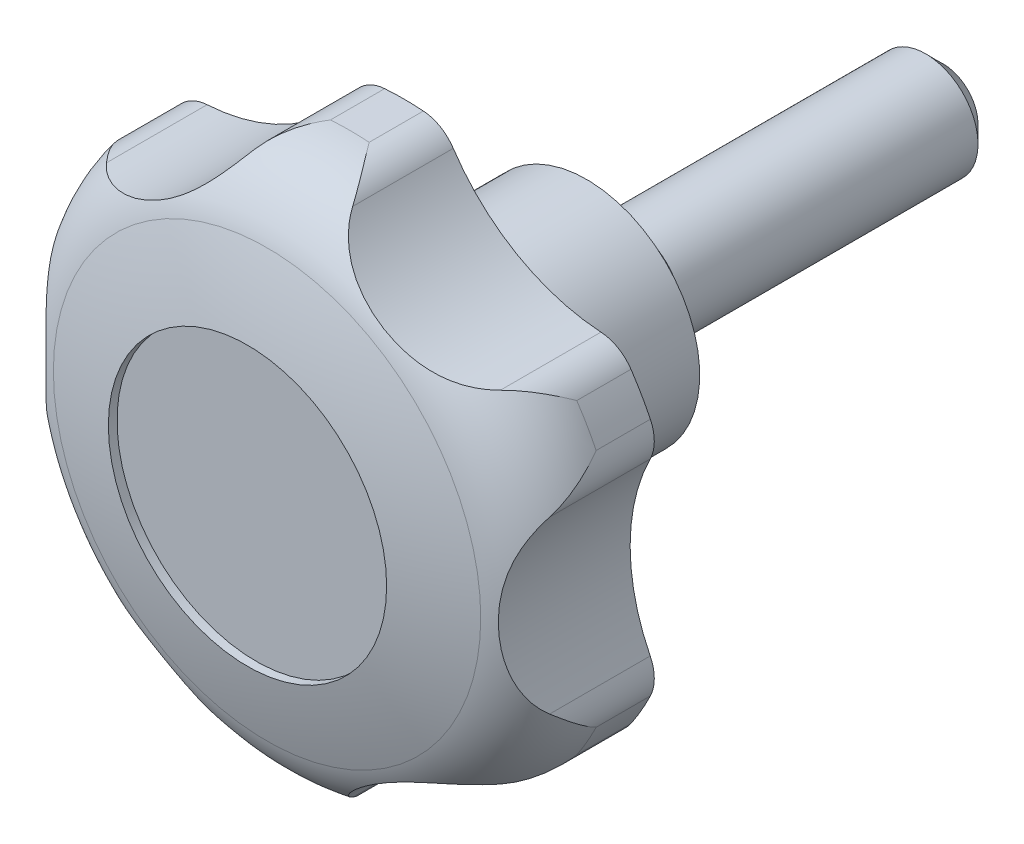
ISO-10303-21;
HEADER;
FILE_DESCRIPTION(('STEP AP214'),'2;1');
FILE_NAME('part.step','',(''),(''),'','','');
FILE_SCHEMA(('AUTOMOTIVE_DESIGN { 1 0 10303 214 1 1 1 1 }'));
ENDSEC;
DATA;
#1=APPLICATION_CONTEXT('core data for automotive mechanical design processes');
#2=APPLICATION_PROTOCOL_DEFINITION('international standard','automotive_design',2000,#1);
#3=PRODUCT_CONTEXT('',#1,'mechanical');
#4=PRODUCT('Part','Part','',(#3));
#5=PRODUCT_RELATED_PRODUCT_CATEGORY('part','',(#4));
#6=PRODUCT_DEFINITION_FORMATION('','',#4);
#7=PRODUCT_DEFINITION_CONTEXT('part definition',#1,'design');
#8=PRODUCT_DEFINITION('design','',#6,#7);
#9=PRODUCT_DEFINITION_SHAPE('','',#8);
#10=(LENGTH_UNIT() NAMED_UNIT(*) SI_UNIT(.MILLI.,.METRE.));
#11=(NAMED_UNIT(*) PLANE_ANGLE_UNIT() SI_UNIT($,.RADIAN.));
#12=(NAMED_UNIT(*) SI_UNIT($,.STERADIAN.) SOLID_ANGLE_UNIT());
#13=UNCERTAINTY_MEASURE_WITH_UNIT(LENGTH_MEASURE(1.E-05),#10,'distance_accuracy_value','');
#14=(GEOMETRIC_REPRESENTATION_CONTEXT(3) GLOBAL_UNCERTAINTY_ASSIGNED_CONTEXT((#13)) GLOBAL_UNIT_ASSIGNED_CONTEXT((#10,
#11,#12)) REPRESENTATION_CONTEXT('',''));
#15=CARTESIAN_POINT('',(0.,0.,0.));
#16=DIRECTION('',(0.,0.,1.));
#17=DIRECTION('',(1.,0.,0.));
#18=AXIS2_PLACEMENT_3D('',#15,#16,#17);
#19=CARTESIAN_POINT('',(0.,0.,44.4940294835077));
#20=DIRECTION('',(0.,0.,1.));
#21=DIRECTION('',(-1.,0.,0.));
#22=AXIS2_PLACEMENT_3D('',#19,#20,#21);
#23=CYLINDRICAL_SURFACE('',#22,31.5000000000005);
#24=CARTESIAN_POINT('',(0.,0.,22.));
#25=DIRECTION('',(0.,0.,1.));
#26=DIRECTION('',(-1.,0.,0.));
#27=AXIS2_PLACEMENT_3D('',#24,#25,#26);
#28=CIRCLE('',#27,31.5000000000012);
#29=CARTESIAN_POINT('',(26.0979777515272,-17.639318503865,22.));
#30=VERTEX_POINT('',#29);
#31=CARTESIAN_POINT('',(28.3250868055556,-13.7818524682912,22.));
#32=VERTEX_POINT('',#31);
#33=EDGE_CURVE('E472',#30,#32,#28,.T.);
#34=ORIENTED_EDGE('',*,*,#33,.T.);
#35=DIRECTION('',(0.,0.,1.));
#36=VECTOR('',#35,1.);
#37=CARTESIAN_POINT('',(28.3250868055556,-13.7818524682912,-38.999999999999));
#38=LINE('',#37,#36);
#39=CARTESIAN_POINT('',(28.3250868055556,-13.7818524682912,28.232767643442));
#40=VERTEX_POINT('',#39);
#41=EDGE_CURVE('E182',#32,#40,#38,.T.);
#42=ORIENTED_EDGE('',*,*,#41,.T.);
#43=CARTESIAN_POINT('',(0.,0.,28.232767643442));
#44=DIRECTION('',(0.,0.,1.));
#45=DIRECTION('',(-1.,0.,0.));
#46=AXIS2_PLACEMENT_3D('',#43,#44,#45);
#47=CIRCLE('',#46,31.5);
#48=CARTESIAN_POINT('',(26.0979777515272,-17.639318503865,28.232767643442));
#49=VERTEX_POINT('',#48);
#50=EDGE_CURVE('E198',#49,#40,#47,.T.);
#51=ORIENTED_EDGE('',*,*,#50,.F.);
#52=DIRECTION('',(0.,0.,1.));
#53=VECTOR('',#52,1.);
#54=CARTESIAN_POINT('',(26.0979777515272,-17.639318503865,-38.999999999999));
#55=LINE('',#54,#53);
#56=EDGE_CURVE('E618',#30,#49,#55,.T.);
#57=ORIENTED_EDGE('',*,*,#56,.F.);
#58=EDGE_LOOP('',(#34,#42,#51,#57));
#59=FACE_BOUND('',#58,.T.);
#60=ADVANCED_FACE('F14',(#59),#23,.T.);
#61=CARTESIAN_POINT('',(-2.22710905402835,-31.421170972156,22.));
#62=VERTEX_POINT('',#61);
#63=CARTESIAN_POINT('',(2.22710905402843,-31.4211709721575,22.));
#64=VERTEX_POINT('',#63);
#65=EDGE_CURVE('E475',#62,#64,#28,.T.);
#66=ORIENTED_EDGE('',*,*,#65,.T.);
#67=DIRECTION('',(0.,0.,1.));
#68=VECTOR('',#67,1.);
#69=CARTESIAN_POINT('',(2.22710905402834,-31.421170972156,-38.999999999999));
#70=LINE('',#69,#68);
#71=CARTESIAN_POINT('',(2.22710905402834,-31.421170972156,28.232767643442));
#72=VERTEX_POINT('',#71);
#73=EDGE_CURVE('E610',#64,#72,#70,.T.);
#74=ORIENTED_EDGE('',*,*,#73,.T.);
#75=CARTESIAN_POINT('',(-2.22710905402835,-31.421170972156,28.232767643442));
#76=VERTEX_POINT('',#75);
#77=EDGE_CURVE('E489',#76,#72,#47,.T.);
#78=ORIENTED_EDGE('',*,*,#77,.F.);
#79=DIRECTION('',(0.,0.,1.));
#80=VECTOR('',#79,1.);
#81=CARTESIAN_POINT('',(-2.22710905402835,-31.421170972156,-38.999999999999));
#82=LINE('',#81,#80);
#83=EDGE_CURVE('E608',#62,#76,#82,.T.);
#84=ORIENTED_EDGE('',*,*,#83,.F.);
#85=EDGE_LOOP('',(#66,#74,#78,#84));
#86=FACE_BOUND('',#85,.T.);
#87=ADVANCED_FACE('F438',(#86),#23,.T.);
#88=CARTESIAN_POINT('',(-28.3250868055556,-13.7818524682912,22.));
#89=VERTEX_POINT('',#88);
#90=CARTESIAN_POINT('',(-26.0979777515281,-17.6393185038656,22.));
#91=VERTEX_POINT('',#90);
#92=EDGE_CURVE('E478',#89,#91,#28,.T.);
#93=ORIENTED_EDGE('',*,*,#92,.T.);
#94=DIRECTION('',(0.,0.,1.));
#95=VECTOR('',#94,1.);
#96=CARTESIAN_POINT('',(-26.0979777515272,-17.639318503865,-38.999999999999));
#97=LINE('',#96,#95);
#98=CARTESIAN_POINT('',(-26.0979777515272,-17.639318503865,28.232767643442));
#99=VERTEX_POINT('',#98);
#100=EDGE_CURVE('E599',#91,#99,#97,.T.);
#101=ORIENTED_EDGE('',*,*,#100,.T.);
#102=CARTESIAN_POINT('',(-28.3250868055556,-13.7818524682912,28.232767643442));
#103=VERTEX_POINT('',#102);
#104=EDGE_CURVE('E485',#103,#99,#47,.T.);
#105=ORIENTED_EDGE('',*,*,#104,.F.);
#106=DIRECTION('',(0.,0.,1.));
#107=VECTOR('',#106,1.);
#108=CARTESIAN_POINT('',(-28.3250868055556,-13.7818524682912,-38.999999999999));
#109=LINE('',#108,#107);
#110=EDGE_CURVE('E593',#89,#103,#109,.T.);
#111=ORIENTED_EDGE('',*,*,#110,.F.);
#112=EDGE_LOOP('',(#93,#101,#105,#111));
#113=FACE_BOUND('',#112,.T.);
#114=ADVANCED_FACE('F446',(#113),#23,.T.);
#115=CARTESIAN_POINT('',(-26.0979777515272,17.639318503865,22.));
#116=VERTEX_POINT('',#115);
#117=CARTESIAN_POINT('',(-28.3250868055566,13.7818524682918,22.));
#118=VERTEX_POINT('',#117);
#119=EDGE_CURVE('E477',#116,#118,#28,.T.);
#120=ORIENTED_EDGE('',*,*,#119,.T.);
#121=DIRECTION('',(0.,0.,1.));
#122=VECTOR('',#121,1.);
#123=CARTESIAN_POINT('',(-28.3250868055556,13.7818524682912,-38.999999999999));
#124=LINE('',#123,#122);
#125=CARTESIAN_POINT('',(-28.3250868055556,13.7818524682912,28.232767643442));
#126=VERTEX_POINT('',#125);
#127=EDGE_CURVE('E37',#118,#126,#124,.T.);
#128=ORIENTED_EDGE('',*,*,#127,.T.);
#129=CARTESIAN_POINT('',(-26.0979777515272,17.639318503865,28.232767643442));
#130=VERTEX_POINT('',#129);
#131=EDGE_CURVE('E482',#130,#126,#47,.T.);
#132=ORIENTED_EDGE('',*,*,#131,.F.);
#133=DIRECTION('',(0.,0.,1.));
#134=VECTOR('',#133,1.);
#135=CARTESIAN_POINT('',(-26.0979777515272,17.639318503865,-38.999999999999));
#136=LINE('',#135,#134);
#137=EDGE_CURVE('E580',#116,#130,#136,.T.);
#138=ORIENTED_EDGE('',*,*,#137,.F.);
#139=EDGE_LOOP('',(#120,#128,#132,#138));
#140=FACE_BOUND('',#139,.T.);
#141=ADVANCED_FACE('F459',(#140),#23,.T.);
#142=CARTESIAN_POINT('',(2.22710905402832,31.4211709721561,22.));
#143=VERTEX_POINT('',#142);
#144=CARTESIAN_POINT('',(-2.22710905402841,31.4211709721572,22.));
#145=VERTEX_POINT('',#144);
#146=EDGE_CURVE('E473',#143,#145,#28,.T.);
#147=ORIENTED_EDGE('',*,*,#146,.T.);
#148=DIRECTION('',(0.,0.,1.));
#149=VECTOR('',#148,1.);
#150=CARTESIAN_POINT('',(-2.22710905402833,31.4211709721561,-38.999999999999));
#151=LINE('',#150,#149);
#152=CARTESIAN_POINT('',(-2.22710905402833,31.4211709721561,28.232767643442));
#153=VERTEX_POINT('',#152);
#154=EDGE_CURVE('E634',#145,#153,#151,.T.);
#155=ORIENTED_EDGE('',*,*,#154,.T.);
#156=CARTESIAN_POINT('',(2.22710905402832,31.4211709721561,28.232767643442));
#157=VERTEX_POINT('',#156);
#158=EDGE_CURVE('E645',#157,#153,#47,.T.);
#159=ORIENTED_EDGE('',*,*,#158,.F.);
#160=DIRECTION('',(0.,0.,1.));
#161=VECTOR('',#160,1.);
#162=CARTESIAN_POINT('',(2.22710905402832,31.4211709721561,-38.999999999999));
#163=LINE('',#162,#161);
#164=EDGE_CURVE('E632',#143,#157,#163,.T.);
#165=ORIENTED_EDGE('',*,*,#164,.F.);
#166=EDGE_LOOP('',(#147,#155,#159,#165));
#167=FACE_BOUND('',#166,.T.);
#168=ADVANCED_FACE('F451',(#167),#23,.T.);
#169=CARTESIAN_POINT('',(28.3250868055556,13.7818524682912,22.));
#170=VERTEX_POINT('',#169);
#171=CARTESIAN_POINT('',(26.0979777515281,17.6393185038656,22.));
#172=VERTEX_POINT('',#171);
#173=EDGE_CURVE('E465',#170,#172,#28,.T.);
#174=ORIENTED_EDGE('',*,*,#173,.T.);
#175=DIRECTION('',(0.,0.,1.));
#176=VECTOR('',#175,1.);
#177=CARTESIAN_POINT('',(26.0979777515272,17.639318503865,-38.999999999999));
#178=LINE('',#177,#176);
#179=CARTESIAN_POINT('',(26.0979777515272,17.639318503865,28.232767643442));
#180=VERTEX_POINT('',#179);
#181=EDGE_CURVE('E467',#172,#180,#178,.T.);
#182=ORIENTED_EDGE('',*,*,#181,.T.);
#183=CARTESIAN_POINT('',(28.3250868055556,13.7818524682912,28.232767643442));
#184=VERTEX_POINT('',#183);
#185=EDGE_CURVE('E647',#184,#180,#47,.T.);
#186=ORIENTED_EDGE('',*,*,#185,.F.);
#187=DIRECTION('',(0.,0.,1.));
#188=VECTOR('',#187,1.);
#189=CARTESIAN_POINT('',(28.3250868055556,13.7818524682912,-38.999999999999));
#190=LINE('',#189,#188);
#191=EDGE_CURVE('E469',#170,#184,#190,.T.);
#192=ORIENTED_EDGE('',*,*,#191,.F.);
#193=EDGE_LOOP('',(#174,#182,#186,#192));
#194=FACE_BOUND('',#193,.T.);
#195=ADVANCED_FACE('F440',(#194),#23,.T.);
#196=CARTESIAN_POINT('',(0.,0.,-38.3836717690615));
#197=DIRECTION('',(-1.,0.,0.));
#198=DIRECTION('',(0.,0.,-1.));
#199=AXIS2_PLACEMENT_3D('',#196,#197,#198);
#200=SPHERICAL_SURFACE('',#199,80.);
#201=CARTESIAN_POINT('',(0.,0.,-38.3836717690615));
#202=DIRECTION('',(0.,0.,1.));
#203=DIRECTION('',(-1.,0.,0.));
#204=AXIS2_PLACEMENT_3D('',#201,#202,#203);
#205=SPHERICAL_SURFACE('',#204,80.);
#206=CARTESIAN_POINT('',(0.,0.,37.7494018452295));
#207=DIRECTION('',(0.,0.,1.));
#208=DIRECTION('',(-1.,0.,0.));
#209=AXIS2_PLACEMENT_3D('',#206,#207,#208);
#210=CIRCLE('',#209,24.5714285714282);
#211=CARTESIAN_POINT('',(-24.5714285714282,0.,37.7494018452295));
#212=VERTEX_POINT('',#211);
#213=EDGE_CURVE('E488',#212,#212,#210,.T.);
#214=ORIENTED_EDGE('',*,*,#213,.T.);
#215=EDGE_LOOP('',(#214));
#216=FACE_BOUND('',#215,.T.);
#217=CARTESIAN_POINT('',(0.,0.,40.));
#218=DIRECTION('',(0.,0.,-1.));
#219=DIRECTION('',(1.,0.,0.));
#220=AXIS2_PLACEMENT_3D('',#217,#218,#219);
#221=CIRCLE('',#220,16.);
#222=CARTESIAN_POINT('',(16.,0.,40.));
#223=VERTEX_POINT('',#222);
#224=EDGE_CURVE('E191',#223,#223,#221,.T.);
#225=ORIENTED_EDGE('',*,*,#224,.T.);
#226=EDGE_LOOP('',(#225));
#227=FACE_BOUND('',#226,.T.);
#228=ADVANCED_FACE('F450',(#216,#227),#205,.T.);
#229=CARTESIAN_POINT('',(0.,0.,28.232767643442));
#230=DIRECTION('',(0.,0.,1.));
#231=DIRECTION('',(-1.,0.,0.));
#232=AXIS2_PLACEMENT_3D('',#229,#230,#231);
#233=TOROIDAL_SURFACE('',#232,21.5,10.0000000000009);
#234=CARTESIAN_POINT('',(26.0979777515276,-17.6393185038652,28.232767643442));
#235=CARTESIAN_POINT('',(26.095787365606,-17.642559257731,28.2381661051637));
#236=CARTESIAN_POINT('',(26.0935927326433,-17.6457971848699,28.2435646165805));
#237=CARTESIAN_POINT('',(25.9715048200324,-17.825418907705,28.5433082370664));
#238=CARTESIAN_POINT('',(25.8390070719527,-17.9933768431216,28.8377892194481));
#239=CARTESIAN_POINT('',(25.5505586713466,-18.3097081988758,29.4258443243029));
#240=CARTESIAN_POINT('',(25.3945993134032,-18.4580743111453,29.7194180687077));
#241=CARTESIAN_POINT('',(25.0606133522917,-18.7326906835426,30.3051183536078));
#242=CARTESIAN_POINT('',(24.8825534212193,-18.8589068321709,30.5972420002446));
#243=CARTESIAN_POINT('',(24.506441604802,-19.085843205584,31.1782260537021));
#244=CARTESIAN_POINT('',(24.3084021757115,-19.1865791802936,31.4670883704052));
#245=CARTESIAN_POINT('',(23.8777210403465,-19.3661170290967,32.0631220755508));
#246=CARTESIAN_POINT('',(23.6435822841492,-19.4425638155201,32.3699417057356));
#247=CARTESIAN_POINT('',(23.2789979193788,-19.5283534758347,32.8243186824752));
#248=CARTESIAN_POINT('',(23.15532869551,-19.5521302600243,32.9747023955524));
#249=CARTESIAN_POINT('',(22.9038337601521,-19.5894090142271,33.2733876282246));
#250=CARTESIAN_POINT('',(22.776005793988,-19.6029053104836,33.4216879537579));
#251=CARTESIAN_POINT('',(22.6463394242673,-19.610904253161,33.56876104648));
#252=B_SPLINE_CURVE_WITH_KNOTS('',3,(#234,#235,#236,#237,#238,#239,#240,#241,#242,#243,#244,
#245,#246,#247,#248,#249,#250,#251),.UNSPECIFIED.,.F.,.F.,(4,2,2,2,2,2,2,2,4),(0.,
0.0200000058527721,1.11045859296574,2.20132279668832,3.29385249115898,4.3857052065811,
5.5636296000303,6.15179568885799,6.74028614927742),.UNSPECIFIED.);
#253=CARTESIAN_POINT('',(22.6465394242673,-19.610891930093,33.5685341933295));
#254=VERTEX_POINT('',#253);
#255=EDGE_CURVE('E200',#49,#254,#252,.T.);
#256=ORIENTED_EDGE('',*,*,#255,.F.);
#257=ORIENTED_EDGE('',*,*,#50,.T.);
#258=CARTESIAN_POINT('',(28.3067007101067,-9.8068324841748,33.5687871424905));
#259=CARTESIAN_POINT('',(28.3508912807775,-9.89556849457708,33.4565618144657));
#260=CARTESIAN_POINT('',(28.3917729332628,-9.98498886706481,33.343612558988));
#261=CARTESIAN_POINT('',(28.4670914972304,-10.1648549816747,33.1164224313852));
#262=CARTESIAN_POINT('',(28.5015295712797,-10.2553005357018,33.002181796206));
#263=CARTESIAN_POINT('',(28.5953953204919,-10.5275208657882,32.6579333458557));
#264=CARTESIAN_POINT('',(28.6454651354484,-10.7103641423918,32.4261663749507));
#265=CARTESIAN_POINT('',(28.7218108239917,-11.0760554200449,31.9595965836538));
#266=CARTESIAN_POINT('',(28.7481337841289,-11.258902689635,31.7248007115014));
#267=CARTESIAN_POINT('',(28.7783405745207,-11.6229783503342,31.2525284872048));
#268=CARTESIAN_POINT('',(28.7822209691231,-11.8042064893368,31.0150517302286));
#269=CARTESIAN_POINT('',(28.7634739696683,-12.2980890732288,30.3589883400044));
#270=CARTESIAN_POINT('',(28.718758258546,-12.6072648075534,29.9382841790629));
#271=CARTESIAN_POINT('',(28.5687108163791,-13.2060043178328,29.0945771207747));
#272=CARTESIAN_POINT('',(28.4634632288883,-13.4955946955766,28.6715782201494));
#273=CARTESIAN_POINT('',(28.3285049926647,-13.7748156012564,28.2435645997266));
#274=CARTESIAN_POINT('',(28.3267981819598,-13.7783351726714,28.2381660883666));
#275=CARTESIAN_POINT('',(28.325086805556,-13.7818524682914,28.232767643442));
#276=B_SPLINE_CURVE_WITH_KNOTS('',3,(#258,#259,#260,#261,#262,#263,#264,#265,#266,#267,#268,
#269,#270,#271,#272,#273,#274,#275),.UNSPECIFIED.,.F.,.F.,(4,2,2,2,2,2,2,2,4),(0.,
0.449123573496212,0.898166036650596,1.79532231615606,2.6906957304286,3.58620621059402,
5.15403517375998,6.71968999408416,6.73968999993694),.UNSPECIFIED.);
#277=CARTESIAN_POINT('',(28.3068003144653,-9.8070324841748,33.5685341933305));
#278=VERTEX_POINT('',#277);
#279=EDGE_CURVE('E186',#278,#40,#276,.T.);
#280=ORIENTED_EDGE('',*,*,#279,.F.);
#281=CARTESIAN_POINT('',(28.306899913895,-9.80723248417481,33.5682812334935));
#282=CARTESIAN_POINT('',(28.2673881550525,-9.72789258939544,33.6686385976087));
#283=CARTESIAN_POINT('',(28.227286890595,-9.64616596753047,33.7668454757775));
#284=CARTESIAN_POINT('',(28.1461835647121,-9.47811588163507,33.9588369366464));
#285=CARTESIAN_POINT('',(28.1051815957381,-9.39179288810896,34.0526219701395));
#286=CARTESIAN_POINT('',(27.9813412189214,-9.1264084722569,34.326945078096));
#287=CARTESIAN_POINT('',(27.8975600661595,-8.94071625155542,34.5007229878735));
#288=CARTESIAN_POINT('',(27.7306770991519,-8.55559108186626,34.8277600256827));
#289=CARTESIAN_POINT('',(27.6475773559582,-8.3563223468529,34.9812149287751));
#290=CARTESIAN_POINT('',(27.4831867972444,-7.94415498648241,35.2697558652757));
#291=CARTESIAN_POINT('',(27.4018963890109,-7.73125333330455,35.4048377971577));
#292=CARTESIAN_POINT('',(27.2432790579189,-7.29467382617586,35.656528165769));
#293=CARTESIAN_POINT('',(27.1659377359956,-7.07104190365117,35.7732075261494));
#294=CARTESIAN_POINT('',(27.0164001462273,-6.61410095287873,35.9895642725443));
#295=CARTESIAN_POINT('',(26.944203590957,-6.38079246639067,36.0892426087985));
#296=CARTESIAN_POINT('',(26.8060036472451,-5.90558258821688,36.2729593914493));
#297=CARTESIAN_POINT('',(26.7400171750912,-5.66366006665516,36.356955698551));
#298=CARTESIAN_POINT('',(26.6154160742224,-5.17335643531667,36.5102592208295));
#299=CARTESIAN_POINT('',(26.556802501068,-4.92497440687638,36.5795643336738));
#300=CARTESIAN_POINT('',(26.4181661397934,-4.28729101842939,36.7386967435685));
#301=CARTESIAN_POINT('',(26.3437188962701,-3.8944576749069,36.8193385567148));
#302=CARTESIAN_POINT('',(26.215895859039,-3.1007499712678,36.9533643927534));
#303=CARTESIAN_POINT('',(26.1625301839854,-2.69987184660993,37.0067353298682));
#304=CARTESIAN_POINT('',(26.0777773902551,-1.8924390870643,37.0898241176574));
#305=CARTESIAN_POINT('',(26.0464425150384,-1.4858732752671,37.1194857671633));
#306=CARTESIAN_POINT('',(26.0064401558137,-0.67071626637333,37.1571359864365));
#307=CARTESIAN_POINT('',(25.9977694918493,-0.262125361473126,37.1651275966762));
#308=CARTESIAN_POINT('',(26.0032673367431,0.564334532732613,37.1600141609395));
#309=CARTESIAN_POINT('',(26.0179744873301,0.982197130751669,37.1464115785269));
#310=CARTESIAN_POINT('',(26.0710365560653,1.81513174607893,37.0960704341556));
#311=CARTESIAN_POINT('',(26.1093958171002,2.23020323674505,37.0593276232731));
#312=CARTESIAN_POINT('',(26.2090070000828,3.05355191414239,36.9600301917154));
#313=CARTESIAN_POINT('',(26.2702065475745,3.46184242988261,36.8975345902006));
#314=CARTESIAN_POINT('',(26.414233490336,4.26876333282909,36.7425858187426));
#315=CARTESIAN_POINT('',(26.4970492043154,4.66739881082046,36.6501488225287));
#316=CARTESIAN_POINT('',(26.6518972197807,5.32280567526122,36.466128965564));
#317=CARTESIAN_POINT('',(26.7186645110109,5.58351647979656,36.3840627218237));
#318=CARTESIAN_POINT('',(26.8599386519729,6.09659869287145,36.2024669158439));
#319=CARTESIAN_POINT('',(26.93444315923,6.34897259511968,36.1029426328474));
#320=CARTESIAN_POINT('',(27.0896194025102,6.84271708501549,35.8852972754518));
#321=CARTESIAN_POINT('',(27.1702731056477,7.08411676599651,35.7672295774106));
#322=CARTESIAN_POINT('',(27.3362070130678,7.5544558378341,35.5111726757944));
#323=CARTESIAN_POINT('',(27.4214863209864,7.78339762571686,35.3731873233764));
#324=CARTESIAN_POINT('',(27.574314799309,8.17463300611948,35.1113840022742));
#325=CARTESIAN_POINT('',(27.6413411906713,8.33998254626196,34.9918111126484));
#326=CARTESIAN_POINT('',(27.7758194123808,8.66099232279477,34.7405668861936));
#327=CARTESIAN_POINT('',(27.8432711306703,8.81665500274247,34.6088986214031));
#328=CARTESIAN_POINT('',(27.9779423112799,9.11836971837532,34.3326466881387));
#329=CARTESIAN_POINT('',(28.0451570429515,9.26434887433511,34.1879809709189));
#330=CARTESIAN_POINT('',(28.1777324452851,9.54473083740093,33.8868532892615));
#331=CARTESIAN_POINT('',(28.2430918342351,9.679125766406,33.7303834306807));
#332=CARTESIAN_POINT('',(28.306899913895,9.807232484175,33.5682812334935));
#333=B_SPLINE_CURVE_WITH_KNOTS('',3,(#281,#282,#283,#284,#285,#286,#287,#288,#289,#290,#291,
#292,#293,#294,#295,#296,#297,#298,#299,#300,#301,#302,#303,#304,#305,#306,#307,#308,#309,#310,
#311,#312,#313,#314,#315,#316,#317,#318,#319,#320,#321,#322,#323,#324,#325,#326,#327,#328,#329,
#330,#331,#332),.UNSPECIFIED.,.F.,.F.,(4,2,2,2,2,2,2,2,2,2,2,2,2,2,2,2,2,2,2,2,2,2,2,2,2,4),(0.,
0.401597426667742,0.803153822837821,1.60518118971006,2.39881165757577,3.19261900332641,
3.98328802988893,4.77391284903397,5.56663251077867,6.35946553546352,7.5812750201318,
8.80367023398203,10.028954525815,11.2540668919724,12.5078182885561,13.7617999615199,
15.0129236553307,16.2633726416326,17.1067811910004,17.9499351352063,18.7907051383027,
19.6313127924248,20.2751395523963,20.9188032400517,21.566861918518,22.2153579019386),.UNSPECIFIED.);
#334=CARTESIAN_POINT('',(28.3068003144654,9.80703248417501,33.5685341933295));
#335=VERTEX_POINT('',#334);
#336=EDGE_CURVE('E174',#278,#335,#333,.T.);
#337=ORIENTED_EDGE('',*,*,#336,.T.);
#338=CARTESIAN_POINT('',(28.325086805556,13.7818524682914,28.232767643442));
#339=CARTESIAN_POINT('',(28.3267981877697,13.7783351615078,28.2381661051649));
#340=CARTESIAN_POINT('',(28.3285049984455,13.7748155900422,28.2435646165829));
#341=CARTESIAN_POINT('',(28.4230180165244,13.5792734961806,28.5433082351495));
#342=CARTESIAN_POINT('',(28.5022249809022,13.3805481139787,28.83778921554));
#343=CARTESIAN_POINT('',(28.6319517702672,12.9725787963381,29.4258443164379));
#344=CARTESIAN_POINT('',(28.682460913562,12.763330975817,29.7194180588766));
#345=CARTESIAN_POINT('',(28.7532926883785,12.3367824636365,30.3051183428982));
#346=CARTESIAN_POINT('',(28.7735691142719,12.1194699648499,30.5972419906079));
#347=CARTESIAN_POINT('',(28.7820458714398,11.68027938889,31.1782260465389));
#348=CARTESIAN_POINT('',(28.7702660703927,11.4584042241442,31.4670883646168));
#349=CARTESIAN_POINT('',(28.7104093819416,10.995650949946,32.0631266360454));
#350=CARTESIAN_POINT('',(28.6595438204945,10.7546538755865,32.369950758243));
#351=CARTESIAN_POINT('',(28.551545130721,10.3960145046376,32.8243342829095));
#352=CARTESIAN_POINT('',(28.5103008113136,10.2770237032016,32.9747201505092));
#353=CARTESIAN_POINT('',(28.4168353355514,10.0405799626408,33.2734096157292));
#354=CARTESIAN_POINT('',(28.364608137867,9.92312790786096,33.4217120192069));
#355=CARTESIAN_POINT('',(28.3067007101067,9.80683248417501,33.5687871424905));
#356=B_SPLINE_CURVE_WITH_KNOTS('',3,(#338,#339,#340,#341,#342,#343,#344,#345,#346,#347,#348,
#349,#350,#351,#352,#353,#354,#355),.UNSPECIFIED.,.F.,.F.,(4,2,2,2,2,2,2,2,4),(0.,
0.0200000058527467,1.11045858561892,2.20132278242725,3.29385247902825,4.38570520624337,
5.56364695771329,6.15182175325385,6.74032093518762),.UNSPECIFIED.);
#357=EDGE_CURVE('E181',#184,#335,#356,.T.);
#358=ORIENTED_EDGE('',*,*,#357,.F.);
#359=ORIENTED_EDGE('',*,*,#185,.T.);
#360=CARTESIAN_POINT('',(22.6463394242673,19.610904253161,33.56876104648));
#361=CARTESIAN_POINT('',(22.7452824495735,19.6048058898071,33.456535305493));
#362=CARTESIAN_POINT('',(22.8431636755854,19.5954997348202,33.3435856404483));
#363=CARTESIAN_POINT('',(23.0365917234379,19.5707934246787,33.1163947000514));
#364=CARTESIAN_POINT('',(23.1321389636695,19.555394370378,33.0021536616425));
#365=CARTESIAN_POINT('',(23.4148216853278,19.5005727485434,32.6579040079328));
#366=CARTESIAN_POINT('',(23.5982035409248,19.4525117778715,32.4261362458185));
#367=CARTESIAN_POINT('',(23.953074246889,19.3357813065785,31.959564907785));
#368=CARTESIAN_POINT('',(24.1245860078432,19.2671529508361,31.7247682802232));
#369=CARTESIAN_POINT('',(24.4549878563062,19.1112728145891,31.2524945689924));
#370=CARTESIAN_POINT('',(24.6138760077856,19.0240181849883,31.015017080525));
#371=CARTESIAN_POINT('',(25.0322121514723,18.7608413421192,30.3589586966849));
#372=CARTESIAN_POINT('',(25.2776039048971,18.5675303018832,29.938260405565));
#373=CARTESIAN_POINT('',(25.7210962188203,18.1382205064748,29.0945651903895));
#374=CARTESIAN_POINT('',(25.9192618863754,17.9022813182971,28.6715722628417));
#375=CARTESIAN_POINT('',(26.0935927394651,17.6457971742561,28.2435645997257));
#376=CARTESIAN_POINT('',(26.095787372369,17.6425592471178,28.2381660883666));
#377=CARTESIAN_POINT('',(26.0979777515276,17.6393185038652,28.232767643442));
#378=B_SPLINE_CURVE_WITH_KNOTS('',3,(#360,#361,#362,#363,#364,#365,#366,#367,#368,#369,#370,
#371,#372,#373,#374,#375,#376,#377),.UNSPECIFIED.,.F.,.F.,(4,2,2,2,2,2,2,2,4),(0.,
0.449124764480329,0.89816841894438,1.79532709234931,2.69070285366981,3.5862156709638,
5.15402250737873,6.71965525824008,6.73965526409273),.UNSPECIFIED.);
#379=CARTESIAN_POINT('',(22.6465394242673,19.610891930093,33.56853419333));
#380=VERTEX_POINT('',#379);
#381=EDGE_CURVE('E248',#380,#180,#378,.T.);
#382=ORIENTED_EDGE('',*,*,#381,.F.);
#383=CARTESIAN_POINT('',(22.6467394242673,19.6108796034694,33.5683073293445));
#384=CARTESIAN_POINT('',(22.5582725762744,19.6163314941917,33.6686645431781));
#385=CARTESIAN_POINT('',(22.4674440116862,19.6224662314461,33.7668712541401));
#386=CARTESIAN_POINT('',(22.2813555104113,19.6362540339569,33.9588623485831));
#387=CARTESIAN_POINT('',(22.1860960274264,19.6439069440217,34.0526471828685));
#388=CARTESIAN_POINT('',(21.8943444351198,19.6693507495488,34.3269696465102));
#389=CARTESIAN_POINT('',(21.6916385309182,19.6896406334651,34.5007470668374));
#390=CARTESIAN_POINT('',(21.2746666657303,19.7376791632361,34.8277830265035));
#391=CARTESIAN_POINT('',(21.0605439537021,19.7653474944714,34.9812373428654));
#392=CARTESIAN_POINT('',(20.6213992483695,19.8290657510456,35.2697770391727));
#393=CARTESIAN_POINT('',(20.3963748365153,19.8651175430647,35.4048583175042));
#394=CARTESIAN_POINT('',(19.9389754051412,19.9460417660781,35.6565473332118));
#395=CARTESIAN_POINT('',(19.7066329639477,19.9908787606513,35.7732259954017));
#396=CARTESIAN_POINT('',(19.2361400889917,20.0898471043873,35.989581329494));
#397=CARTESIAN_POINT('',(18.9979899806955,20.1439779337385,36.0892589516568));
#398=CARTESIAN_POINT('',(18.5173447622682,20.2618995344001,36.2729743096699));
#399=CARTESIAN_POINT('',(18.2748398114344,20.3257155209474,36.3569699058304));
#400=CARTESIAN_POINT('',(17.787922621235,20.4629610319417,36.5102720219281));
#401=CARTESIAN_POINT('',(17.5435101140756,20.5363919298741,36.5795764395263));
#402=CARTESIAN_POINT('',(16.9219401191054,20.7351730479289,36.7387072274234));
#403=CARTESIAN_POINT('',(16.5445116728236,20.8671178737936,36.8193480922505));
#404=CARTESIAN_POINT('',(15.793226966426,21.1532765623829,36.9533720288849));
#405=CARTESIAN_POINT('',(15.419372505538,21.3075010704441,37.0067420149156));
#406=CARTESIAN_POINT('',(14.6777370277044,21.6378224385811,37.0898288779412));
#407=CARTESIAN_POINT('',(14.3099724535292,21.8139701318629,37.1194895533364));
#408=CARTESIAN_POINT('',(13.5840231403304,22.1869088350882,37.1571377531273));
#409=CARTESIAN_POINT('',(13.2258370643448,22.383696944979,37.1651283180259));
#410=CARTESIAN_POINT('',(12.5128497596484,22.8016915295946,37.1600126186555));
#411=CARTESIAN_POINT('',(12.1583233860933,23.0233612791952,37.1464088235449));
#412=CARTESIAN_POINT('',(11.4635114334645,23.4857850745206,37.096065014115));
#413=CARTESIAN_POINT('',(11.1232284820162,23.7265426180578,37.0593207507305));
#414=CARTESIAN_POINT('',(10.4599932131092,24.2244861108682,36.960020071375));
#415=CARTESIAN_POINT('',(10.1370031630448,24.4816333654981,36.8975226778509));
#416=CARTESIAN_POINT('',(9.51020318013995,25.0098279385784,36.7425698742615));
#417=CARTESIAN_POINT('',(9.20638299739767,25.2808676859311,36.6501306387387));
#418=CARTESIAN_POINT('',(8.71621052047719,25.7426742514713,36.466107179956));
#419=CARTESIAN_POINT('',(8.5238139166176,25.9308511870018,36.3840398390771));
#420=CARTESIAN_POINT('',(8.15011259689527,26.3097378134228,36.2024418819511));
#421=CARTESIAN_POINT('',(7.96880455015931,26.5004467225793,36.1029165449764));
#422=CARTESIAN_POINT('',(7.61880117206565,26.8817036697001,35.8852691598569));
#423=CARTESIAN_POINT('',(7.45007162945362,27.07225063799,35.767200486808));
#424=CARTESIAN_POINT('',(7.12571667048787,27.45112090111,35.5111417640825));
#425=CARTESIAN_POINT('',(6.97008873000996,27.639444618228,35.3731555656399));
#426=CARTESIAN_POINT('',(6.70768734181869,27.9674120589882,35.1113519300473));
#427=CARTESIAN_POINT('',(6.59800591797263,28.1081310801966,34.9917796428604));
#428=CARTESIAN_POINT('',(6.38724675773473,28.3850929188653,34.7405369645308));
#429=CARTESIAN_POINT('',(6.28616684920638,28.521336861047,34.6088696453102));
#430=CARTESIAN_POINT('',(6.09221377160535,28.7888183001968,34.3326200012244));
#431=CARTESIAN_POINT('',(5.99940134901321,28.9200152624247,34.1879556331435));
#432=CARTESIAN_POINT('',(5.82287463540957,29.1750154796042,33.8868310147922));
#433=CARTESIAN_POINT('',(5.73916652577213,29.2988136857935,33.730362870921));
#434=CARTESIAN_POINT('',(5.66012837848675,29.4181244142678,33.568262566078));
#435=B_SPLINE_CURVE_WITH_KNOTS('',3,(#383,#384,#385,#386,#387,#388,#389,#390,#391,#392,#393,
#394,#395,#396,#397,#398,#399,#400,#401,#402,#403,#404,#405,#406,#407,#408,#409,#410,#411,#412,
#413,#414,#415,#416,#417,#418,#419,#420,#421,#422,#423,#424,#425,#426,#427,#428,#429,#430,#431,
#432,#433,#434),.UNSPECIFIED.,.F.,.F.,(4,2,2,2,2,2,2,2,2,2,2,2,2,2,2,2,2,2,2,2,2,2,2,2,2,4),(0.,
0.401598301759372,0.803155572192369,1.60518467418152,2.39881681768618,3.19262584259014,
3.98329649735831,4.77392294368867,5.56664425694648,6.3594789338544,7.58129241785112,
8.80369163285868,10.028979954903,11.2540963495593,12.5078513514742,13.7618366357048,
15.0129638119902,16.2634162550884,17.1068205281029,17.9499701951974,18.7907359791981,
19.6313394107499,20.2751571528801,20.91881182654,21.5668612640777,22.215347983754),.UNSPECIFIED.);
#436=CARTESIAN_POINT('',(5.66026089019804,29.4179244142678,33.568534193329));
#437=VERTEX_POINT('',#436);
#438=EDGE_CURVE('E254',#380,#437,#435,.T.);
#439=ORIENTED_EDGE('',*,*,#438,.T.);
#440=CARTESIAN_POINT('',(2.22710905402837,31.4211709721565,28.232767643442));
#441=CARTESIAN_POINT('',(2.23101082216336,31.4208944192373,28.2381661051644));
#442=CARTESIAN_POINT('',(2.23491226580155,31.4206127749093,28.2435646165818));
#443=CARTESIAN_POINT('',(2.45151319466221,31.4046924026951,28.5433082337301));
#444=CARTESIAN_POINT('',(2.66321790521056,31.3739249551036,28.8377892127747));
#445=CARTESIAN_POINT('',(3.08139309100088,31.282286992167,29.4258443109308));
#446=CARTESIAN_POINT('',(3.2878615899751,31.2214052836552,29.7194180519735));
#447=CARTESIAN_POINT('',(3.69267932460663,31.0694731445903,30.3051183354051));
#448=CARTESIAN_POINT('',(3.89101568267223,30.9783767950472,30.5972419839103));
#449=CARTESIAN_POINT('',(4.27560425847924,30.7661225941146,31.1782260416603));
#450=CARTESIAN_POINT('',(4.46186388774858,30.6449834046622,31.4670883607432));
#451=CARTESIAN_POINT('',(4.8326936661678,30.3617678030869,32.0631298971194));
#452=CARTESIAN_POINT('',(5.01597231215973,30.197216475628,32.3699572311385));
#453=CARTESIAN_POINT('',(5.27256609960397,29.9243637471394,32.824345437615));
#454=CARTESIAN_POINT('',(5.35499370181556,29.8291484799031,32.9747328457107));
#455=CARTESIAN_POINT('',(5.51302848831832,29.629980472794,33.2734253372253));
#456=CARTESIAN_POINT('',(5.58863188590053,29.5260229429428,33.4217292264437));
#457=CARTESIAN_POINT('',(5.66039339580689,29.4177244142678,33.5688058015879));
#458=B_SPLINE_CURVE_WITH_KNOTS('',3,(#440,#441,#442,#443,#444,#445,#446,#447,#448,#449,#450,
#451,#452,#453,#454,#455,#456,#457),.UNSPECIFIED.,.F.,.F.,(4,2,2,2,2,2,2,2,4),(0.,
0.0200000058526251,1.11045858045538,2.20132277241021,3.29385247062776,4.38570520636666,
5.56365936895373,6.15184038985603,6.74034580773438),.UNSPECIFIED.);
#459=EDGE_CURVE('E277',#157,#437,#458,.T.);
#460=ORIENTED_EDGE('',*,*,#459,.F.);
#461=ORIENTED_EDGE('',*,*,#158,.T.);
#462=CARTESIAN_POINT('',(-5.66039339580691,29.4177244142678,33.5688058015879));
#463=CARTESIAN_POINT('',(-5.60564139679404,29.5003626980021,33.4565807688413));
#464=CARTESIAN_POINT('',(-5.54864226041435,29.5804775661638,33.3436318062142));
#465=CARTESIAN_POINT('',(-5.43053361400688,29.7356386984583,33.1164422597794));
#466=CARTESIAN_POINT('',(-5.36942484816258,29.8106858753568,33.0022019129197));
#467=CARTESIAN_POINT('',(-5.18060902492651,30.028086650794,32.6579543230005));
#468=CARTESIAN_POINT('',(-5.04729767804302,30.1628703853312,32.4261879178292));
#469=CARTESIAN_POINT('',(-4.76877388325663,30.4118341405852,31.9596192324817));
#470=CARTESIAN_POINT('',(-4.62358561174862,30.5260545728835,31.7248239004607));
#471=CARTESIAN_POINT('',(-4.32339145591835,30.7342532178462,31.2525527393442));
#472=CARTESIAN_POINT('',(-4.16838407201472,30.8282283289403,31.0150765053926));
#473=CARTESIAN_POINT('',(-3.73129394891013,31.0589375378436,30.359009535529));
#474=CARTESIAN_POINT('',(-3.44117937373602,31.1748025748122,29.9383011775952));
#475=CARTESIAN_POINT('',(-2.84762630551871,31.3442303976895,29.0945856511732));
#476=CARTESIAN_POINT('',(-2.54420684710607,31.3978793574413,28.6715824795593));
#477=CARTESIAN_POINT('',(-2.23491225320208,31.4206127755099,28.2435645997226));
#478=CARTESIAN_POINT('',(-2.23101080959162,31.4208944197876,28.2381660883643));
#479=CARTESIAN_POINT('',(-2.22710905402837,31.4211709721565,28.232767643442));
#480=B_SPLINE_CURVE_WITH_KNOTS('',3,(#462,#463,#464,#465,#466,#467,#468,#469,#470,#471,#472,
#473,#474,#475,#476,#477,#478,#479),.UNSPECIFIED.,.F.,.F.,(4,2,2,2,2,2,2,2,4),(0.,
0.44912272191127,0.898164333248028,1.7953189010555,2.69069063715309,3.58619944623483,
5.15404423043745,6.71971483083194,6.73971483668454),.UNSPECIFIED.);
#481=CARTESIAN_POINT('',(-5.66026089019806,29.4179244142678,33.56853419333));
#482=VERTEX_POINT('',#481);
#483=EDGE_CURVE('E283',#482,#153,#480,.T.);
#484=ORIENTED_EDGE('',*,*,#483,.F.);
#485=CARTESIAN_POINT('',(-5.66012837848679,29.4181244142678,33.568262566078));
#486=CARTESIAN_POINT('',(-5.70908256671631,29.3442366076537,33.6686200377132));
#487=CARTESIAN_POINT('',(-5.75980896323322,29.268644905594,33.7668270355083));
#488=CARTESIAN_POINT('',(-5.86479233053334,29.1143829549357,33.9588187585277));
#489=CARTESIAN_POINT('',(-5.91904894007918,29.0357130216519,34.0526039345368));
#490=CARTESIAN_POINT('',(-6.08695745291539,28.7957728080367,34.3269275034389));
#491=CARTESIAN_POINT('',(-6.20588041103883,28.6303706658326,34.5007057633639));
#492=CARTESIAN_POINT('',(-6.45596580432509,28.2932842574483,34.8277435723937));
#493=CARTESIAN_POINT('',(-6.58698706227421,28.1216838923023,34.9811988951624));
#494=CARTESIAN_POINT('',(-6.86173785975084,27.7732347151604,35.2697407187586));
#495=CARTESIAN_POINT('',(-7.00547022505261,27.5963847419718,35.4048231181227));
#496=CARTESIAN_POINT('',(-7.30424916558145,27.2407290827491,35.6565144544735));
#497=CARTESIAN_POINT('',(-7.45924876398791,27.0619338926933,35.7731943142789));
#498=CARTESIAN_POINT('',(-7.7802011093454,26.7039606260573,35.9895520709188));
#499=CARTESIAN_POINT('',(-7.94615324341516,26.5247825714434,36.089230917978));
#500=CARTESIAN_POINT('',(-8.28859577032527,26.1674933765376,36.2729487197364));
#501=CARTESIAN_POINT('',(-8.46511292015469,25.9893863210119,36.3569455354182));
#502=CARTESIAN_POINT('',(-8.82742645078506,25.6363270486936,36.5102500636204));
#503=CARTESIAN_POINT('',(-9.0132241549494,25.4613752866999,36.5795556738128));
#504=CARTESIAN_POINT('',(-9.49615408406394,25.022471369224,36.7386892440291));
#505=CARTESIAN_POINT('',(-9.79913285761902,24.7615817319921,36.8193317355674));
#506=CARTESIAN_POINT('',(-10.4225898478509,24.2540302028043,36.9533589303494));
#507=CARTESIAN_POINT('',(-10.7430763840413,24.0073751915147,37.0067305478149));
#508=CARTESIAN_POINT('',(-11.3999547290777,23.5302607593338,37.089820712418));
#509=CARTESIAN_POINT('',(-11.7363823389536,23.2998409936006,37.1194830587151));
#510=CARTESIAN_POINT('',(-12.422325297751,22.8576191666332,37.1571347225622));
#511=CARTESIAN_POINT('',(-12.7718388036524,22.645814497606,37.1651270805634));
#512=CARTESIAN_POINT('',(-13.4903205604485,22.2373452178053,37.1600152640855));
#513=CARTESIAN_POINT('',(-13.8595526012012,22.041150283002,37.1464135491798));
#514=CARTESIAN_POINT('',(-14.6074239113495,21.670635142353,37.096074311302));
#515=CARTESIAN_POINT('',(-14.9860648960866,21.4963189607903,37.0593325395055));
#516=CARTESIAN_POINT('',(-15.7489092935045,21.1709092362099,36.9600374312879));
#517=CARTESIAN_POINT('',(-16.1330980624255,21.0197636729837,36.8975431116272));
#518=CARTESIAN_POINT('',(-16.9039237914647,20.7410327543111,36.7425972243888));
#519=CARTESIAN_POINT('',(-17.290559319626,20.6134347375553,36.6501618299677));
#520=CARTESIAN_POINT('',(-17.9355827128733,20.4198317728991,36.4661445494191));
#521=CARTESIAN_POINT('',(-18.1947496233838,20.3472975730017,36.3840790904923));
#522=CARTESIAN_POINT('',(-18.7097312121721,20.2131016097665,36.2024848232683));
#523=CARTESIAN_POINT('',(-18.9655468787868,20.151436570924,36.1029612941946));
#524=CARTESIAN_POINT('',(-19.4707327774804,20.0389492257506,35.8853173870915));
#525=CARTESIAN_POINT('',(-19.7201191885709,19.9880967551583,35.7672503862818));
#526=CARTESIAN_POINT('',(-20.2104144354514,19.8966287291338,35.5111947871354));
#527=CARTESIAN_POINT('',(-20.4513248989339,19.8560111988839,35.3732100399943));
#528=CARTESIAN_POINT('',(-20.8665614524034,19.7927457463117,35.1114076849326));
#529=CARTESIAN_POINT('',(-21.043272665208,19.7681170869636,34.9918351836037));
#530=CARTESIAN_POINT('',(-21.3885166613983,19.7240729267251,34.7405916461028));
#531=CARTESIAN_POINT('',(-21.5570515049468,19.7046561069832,34.608923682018));
#532=CARTESIAN_POINT('',(-21.8856820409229,19.6704267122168,34.332672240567));
#533=CARTESIAN_POINT('',(-22.0457122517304,19.6556464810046,34.1880067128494));
#534=CARTESIAN_POINT('',(-22.3548202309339,19.6302685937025,33.886879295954));
#535=CARTESIAN_POINT('',(-22.5038905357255,19.6196737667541,33.7304095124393));
#536=CARTESIAN_POINT('',(-22.6467394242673,19.6108796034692,33.5683073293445));
#537=B_SPLINE_CURVE_WITH_KNOTS('',3,(#485,#486,#487,#488,#489,#490,#491,#492,#493,#494,#495,
#496,#497,#498,#499,#500,#501,#502,#503,#504,#505,#506,#507,#508,#509,#510,#511,#512,#513,#514,
#515,#516,#517,#518,#519,#520,#521,#522,#523,#524,#525,#526,#527,#528,#529,#530,#531,#532,#533,
#534,#535,#536),.UNSPECIFIED.,.F.,.F.,(4,2,2,2,2,2,2,2,2,2,2,2,2,2,2,2,2,2,2,2,2,2,2,2,2,4),(0.,
0.401596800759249,0.80315257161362,1.60517869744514,2.39880796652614,3.19261411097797,
3.98328197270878,4.77390562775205,5.56662410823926,6.35945595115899,7.58126257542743,
8.80365492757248,10.0289363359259,11.254045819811,12.507794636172,13.7617737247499,
15.0128949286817,16.2633414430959,17.1067530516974,17.949910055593,18.790683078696,
19.6312937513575,20.2751227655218,20.9187887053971,21.5668497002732,22.2153480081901),.UNSPECIFIED.);
#538=CARTESIAN_POINT('',(-22.6465394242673,19.610891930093,33.5685341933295));
#539=VERTEX_POINT('',#538);
#540=EDGE_CURVE('E289',#482,#539,#537,.T.);
#541=ORIENTED_EDGE('',*,*,#540,.T.);
#542=CARTESIAN_POINT('',(-26.0979777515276,17.6393185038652,28.232767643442));
#543=CARTESIAN_POINT('',(-26.0957873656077,17.6425592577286,28.2381661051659));
#544=CARTESIAN_POINT('',(-26.0935927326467,17.645797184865,28.2435646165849));
#545=CARTESIAN_POINT('',(-25.9715048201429,17.8254189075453,28.5433082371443));
#546=CARTESIAN_POINT('',(-25.8390070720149,17.9933768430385,28.8377892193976));
#547=CARTESIAN_POINT('',(-25.5505586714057,18.3097081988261,29.4258443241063));
#548=CARTESIAN_POINT('',(-25.3945993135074,18.4580743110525,29.7194180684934));
#549=CARTESIAN_POINT('',(-25.0606133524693,18.7326906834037,30.305118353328));
#550=CARTESIAN_POINT('',(-24.8825534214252,18.8589068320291,30.597241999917));
#551=CARTESIAN_POINT('',(-24.5064416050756,19.0858432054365,31.178226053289));
#552=CARTESIAN_POINT('',(-24.3084021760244,19.186579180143,31.4670883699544));
#553=CARTESIAN_POINT('',(-23.8777210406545,19.3661170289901,32.0631220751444));
#554=CARTESIAN_POINT('',(-23.6435822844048,19.4425638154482,32.3699417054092));
#555=CARTESIAN_POINT('',(-23.2789979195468,19.5283534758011,32.8243186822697));
#556=CARTESIAN_POINT('',(-23.1553286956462,19.5521302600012,32.9747023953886));
#557=CARTESIAN_POINT('',(-22.9038337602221,19.5894090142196,33.2733876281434));
#558=CARTESIAN_POINT('',(-22.7760057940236,19.6029053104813,33.4216879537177));
#559=CARTESIAN_POINT('',(-22.6463394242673,19.610904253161,33.56876104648));
#560=B_SPLINE_CURVE_WITH_KNOTS('',3,(#542,#543,#544,#545,#546,#547,#548,#549,#550,#551,#552,
#553,#554,#555,#556,#557,#558,#559),.UNSPECIFIED.,.F.,.F.,(4,2,2,2,2,2,2,2,4),(0.,
0.0200000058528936,1.11045859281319,2.20132279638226,3.29385249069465,4.3857052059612,
5.5636295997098,6.1517956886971,6.74028614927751),.UNSPECIFIED.);
#561=EDGE_CURVE('E296',#130,#539,#560,.T.);
#562=ORIENTED_EDGE('',*,*,#561,.F.);
#563=ORIENTED_EDGE('',*,*,#131,.T.);
#564=CARTESIAN_POINT('',(-28.3067007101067,9.8068324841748,33.5687871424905));
#565=CARTESIAN_POINT('',(-28.3508912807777,9.89556849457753,33.4565618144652));
#566=CARTESIAN_POINT('',(-28.3917729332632,9.98498886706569,33.343612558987));
#567=CARTESIAN_POINT('',(-28.467091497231,10.1648549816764,33.1164224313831));
#568=CARTESIAN_POINT('',(-28.5015295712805,10.255300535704,33.0021817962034));
#569=CARTESIAN_POINT('',(-28.5953953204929,10.5275208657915,32.6579333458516));
#570=CARTESIAN_POINT('',(-28.6454651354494,10.7103641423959,32.4261663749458));
#571=CARTESIAN_POINT('',(-28.7218108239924,11.0760554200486,31.9595965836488));
#572=CARTESIAN_POINT('',(-28.7481337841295,11.2589026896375,31.7248007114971));
#573=CARTESIAN_POINT('',(-28.7783405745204,11.6229783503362,31.2525284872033));
#574=CARTESIAN_POINT('',(-28.7822209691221,11.8042064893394,31.0150517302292));
#575=CARTESIAN_POINT('',(-28.76347396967,12.2980890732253,30.3589883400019));
#576=CARTESIAN_POINT('',(-28.7187582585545,12.6072648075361,29.9382841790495));
#577=CARTESIAN_POINT('',(-28.5687108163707,13.2060043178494,29.0945771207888));
#578=CARTESIAN_POINT('',(-28.4634632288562,13.4955946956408,28.6715782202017));
#579=CARTESIAN_POINT('',(-28.3285049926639,13.7748156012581,28.2435645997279));
#580=CARTESIAN_POINT('',(-28.3267981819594,13.7783351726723,28.2381660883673));
#581=CARTESIAN_POINT('',(-28.325086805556,13.7818524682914,28.232767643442));
#582=B_SPLINE_CURVE_WITH_KNOTS('',3,(#564,#565,#566,#567,#568,#569,#570,#571,#572,#573,#574,
#575,#576,#577,#578,#579,#580,#581),.UNSPECIFIED.,.F.,.F.,(4,2,2,2,2,2,2,2,4),(0.,
0.449123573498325,0.898166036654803,1.79532231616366,2.69069573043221,3.58620621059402,
5.15403517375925,6.71968999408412,6.73968999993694),.UNSPECIFIED.);
#583=CARTESIAN_POINT('',(-28.3068003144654,9.8070324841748,33.56853419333));
#584=VERTEX_POINT('',#583);
#585=EDGE_CURVE('E319',#584,#126,#582,.T.);
#586=ORIENTED_EDGE('',*,*,#585,.F.);
#587=CARTESIAN_POINT('',(-28.306899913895,9.8072324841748,33.5682812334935));
#588=CARTESIAN_POINT('',(-28.2673881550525,9.72789258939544,33.6686385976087));
#589=CARTESIAN_POINT('',(-28.227286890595,9.64616596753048,33.7668454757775));
#590=CARTESIAN_POINT('',(-28.1461835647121,9.47811588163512,33.9588369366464));
#591=CARTESIAN_POINT('',(-28.1051815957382,9.39179288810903,34.0526219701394));
#592=CARTESIAN_POINT('',(-27.9813412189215,9.12640847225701,34.3269450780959));
#593=CARTESIAN_POINT('',(-27.8975600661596,8.94071625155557,34.5007229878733));
#594=CARTESIAN_POINT('',(-27.730677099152,8.5555910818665,34.8277600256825));
#595=CARTESIAN_POINT('',(-27.6475773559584,8.3563223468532,34.981214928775));
#596=CARTESIAN_POINT('',(-27.4831867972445,7.94415498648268,35.2697558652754));
#597=CARTESIAN_POINT('',(-27.4018963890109,7.73125333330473,35.4048377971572));
#598=CARTESIAN_POINT('',(-27.2432790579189,7.29467382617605,35.6565281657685));
#599=CARTESIAN_POINT('',(-27.1659377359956,7.07104190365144,35.7732075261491));
#600=CARTESIAN_POINT('',(-27.0164001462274,6.61410095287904,35.9895642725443));
#601=CARTESIAN_POINT('',(-26.9442035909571,6.38079246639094,36.0892426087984));
#602=CARTESIAN_POINT('',(-26.8060036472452,5.90558258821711,36.2729593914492));
#603=CARTESIAN_POINT('',(-26.7400171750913,5.66366006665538,36.3569556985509));
#604=CARTESIAN_POINT('',(-26.6154160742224,5.17335643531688,36.5102592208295));
#605=CARTESIAN_POINT('',(-26.556802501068,4.92497440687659,36.5795643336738));
#606=CARTESIAN_POINT('',(-26.4181661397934,4.28729101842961,36.7386967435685));
#607=CARTESIAN_POINT('',(-26.3437188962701,3.89445767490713,36.8193385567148));
#608=CARTESIAN_POINT('',(-26.2158958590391,3.10074997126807,36.9533643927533));
#609=CARTESIAN_POINT('',(-26.1625301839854,2.69987184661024,37.0067353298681));
#610=CARTESIAN_POINT('',(-26.0777773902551,1.89243908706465,37.0898241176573));
#611=CARTESIAN_POINT('',(-26.0464425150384,1.48587327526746,37.1194857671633));
#612=CARTESIAN_POINT('',(-26.0064401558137,0.670716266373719,37.1571359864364));
#613=CARTESIAN_POINT('',(-25.9977694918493,0.262125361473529,37.1651275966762));
#614=CARTESIAN_POINT('',(-26.0032673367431,-0.564334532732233,37.1600141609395));
#615=CARTESIAN_POINT('',(-26.0179744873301,-0.982197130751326,37.1464115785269));
#616=CARTESIAN_POINT('',(-26.0710365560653,-1.81513174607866,37.0960704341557));
#617=CARTESIAN_POINT('',(-26.1093958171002,-2.23020323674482,37.0593276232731));
#618=CARTESIAN_POINT('',(-26.2090070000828,-3.05355191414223,36.9600301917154));
#619=CARTESIAN_POINT('',(-26.2702065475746,-3.46184242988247,36.8975345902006));
#620=CARTESIAN_POINT('',(-26.414233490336,-4.26876333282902,36.7425858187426));
#621=CARTESIAN_POINT('',(-26.4970492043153,-4.66739881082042,36.6501488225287));
#622=CARTESIAN_POINT('',(-26.6518972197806,-5.32280567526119,36.466128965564));
#623=CARTESIAN_POINT('',(-26.7186645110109,-5.58351647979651,36.3840627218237));
#624=CARTESIAN_POINT('',(-26.8599386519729,-6.09659869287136,36.202466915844));
#625=CARTESIAN_POINT('',(-26.93444315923,-6.34897259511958,36.1029426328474));
#626=CARTESIAN_POINT('',(-27.0896194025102,-6.84271708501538,35.8852972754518));
#627=CARTESIAN_POINT('',(-27.1702731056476,-7.0841167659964,35.7672295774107));
#628=CARTESIAN_POINT('',(-27.3362070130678,-7.55445583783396,35.5111726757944));
#629=CARTESIAN_POINT('',(-27.4214863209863,-7.78339762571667,35.3731873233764));
#630=CARTESIAN_POINT('',(-27.5743147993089,-8.17463300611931,35.1113840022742));
#631=CARTESIAN_POINT('',(-27.6413411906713,-8.33998254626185,34.9918111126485));
#632=CARTESIAN_POINT('',(-27.7758194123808,-8.66099232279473,34.7405668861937));
#633=CARTESIAN_POINT('',(-27.8432711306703,-8.81665500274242,34.6088986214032));
#634=CARTESIAN_POINT('',(-27.9779423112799,-9.11836971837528,34.3326466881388));
#635=CARTESIAN_POINT('',(-28.0451570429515,-9.26434887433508,34.187980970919));
#636=CARTESIAN_POINT('',(-28.177732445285,-9.54473083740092,33.8868532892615));
#637=CARTESIAN_POINT('',(-28.2430918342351,-9.679125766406,33.7303834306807));
#638=CARTESIAN_POINT('',(-28.306899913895,-9.807232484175,33.5682812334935));
#639=B_SPLINE_CURVE_WITH_KNOTS('',3,(#587,#588,#589,#590,#591,#592,#593,#594,#595,#596,#597,
#598,#599,#600,#601,#602,#603,#604,#605,#606,#607,#608,#609,#610,#611,#612,#613,#614,#615,#616,
#617,#618,#619,#620,#621,#622,#623,#624,#625,#626,#627,#628,#629,#630,#631,#632,#633,#634,#635,
#636,#637,#638),.UNSPECIFIED.,.F.,.F.,(4,2,2,2,2,2,2,2,2,2,2,2,2,2,2,2,2,2,2,2,2,2,2,2,2,4),(0.,
0.401597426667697,0.803153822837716,1.60518118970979,2.39881165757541,3.19261900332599,
3.98328802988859,4.77391284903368,5.56663251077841,6.35946553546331,7.58127502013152,
8.80367023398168,10.0289545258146,11.254066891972,12.5078182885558,13.7617999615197,
15.0129236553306,16.2633726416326,17.1067811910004,17.9499351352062,18.7907051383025,
19.6313127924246,20.2751395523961,20.9188032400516,21.5668619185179,22.2153579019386),.UNSPECIFIED.);
#640=CARTESIAN_POINT('',(-28.3068003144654,-9.807032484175,33.5685341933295));
#641=VERTEX_POINT('',#640);
#642=EDGE_CURVE('E325',#584,#641,#639,.T.);
#643=ORIENTED_EDGE('',*,*,#642,.T.);
#644=CARTESIAN_POINT('',(-28.3250868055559,-13.7818524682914,28.232767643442));
#645=CARTESIAN_POINT('',(-28.3267981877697,-13.7783351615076,28.2381661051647));
#646=CARTESIAN_POINT('',(-28.3285049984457,-13.7748155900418,28.2435646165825));
#647=CARTESIAN_POINT('',(-28.4230180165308,-13.579273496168,28.5433082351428));
#648=CARTESIAN_POINT('',(-28.5022249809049,-13.3805481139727,28.8377892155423));
#649=CARTESIAN_POINT('',(-28.6319517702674,-12.9725787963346,29.4258443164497));
#650=CARTESIAN_POINT('',(-28.6824609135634,-12.7633309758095,29.7194180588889));
#651=CARTESIAN_POINT('',(-28.7532926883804,-12.3367824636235,30.305118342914));
#652=CARTESIAN_POINT('',(-28.7735691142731,-12.1194699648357,30.5972419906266));
#653=CARTESIAN_POINT('',(-28.7820458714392,-11.6802793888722,31.1782260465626));
#654=CARTESIAN_POINT('',(-28.7702660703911,-11.4584042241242,31.4670883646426));
#655=CARTESIAN_POINT('',(-28.7104093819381,-10.9956509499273,32.0631266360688));
#656=CARTESIAN_POINT('',(-28.6595438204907,-10.7546538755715,32.3699507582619));
#657=CARTESIAN_POINT('',(-28.5515451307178,-10.3960145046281,32.8243342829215));
#658=CARTESIAN_POINT('',(-28.5103008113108,-10.277023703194,32.9747201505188));
#659=CARTESIAN_POINT('',(-28.4168353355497,-10.0405799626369,33.2734096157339));
#660=CARTESIAN_POINT('',(-28.3646081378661,-9.92312790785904,33.4217120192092));
#661=CARTESIAN_POINT('',(-28.3067007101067,-9.80683248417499,33.5687871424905));
#662=B_SPLINE_CURVE_WITH_KNOTS('',3,(#644,#645,#646,#647,#648,#649,#650,#651,#652,#653,#654,
#655,#656,#657,#658,#659,#660,#661),.UNSPECIFIED.,.F.,.F.,(4,2,2,2,2,2,2,2,4),(0.,
0.0200000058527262,1.11045858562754,2.20132278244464,3.29385247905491,4.38570520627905,
5.56364695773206,6.15182175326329,6.74032093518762),.UNSPECIFIED.);
#663=EDGE_CURVE('E332',#103,#641,#662,.T.);
#664=ORIENTED_EDGE('',*,*,#663,.F.);
#665=ORIENTED_EDGE('',*,*,#104,.T.);
#666=CARTESIAN_POINT('',(-22.6463394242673,-19.610904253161,33.56876104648));
#667=CARTESIAN_POINT('',(-22.7452824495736,-19.6048058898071,33.4565353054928));
#668=CARTESIAN_POINT('',(-22.8431636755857,-19.5954997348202,33.3435856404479));
#669=CARTESIAN_POINT('',(-23.0365917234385,-19.5707934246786,33.1163947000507));
#670=CARTESIAN_POINT('',(-23.1321389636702,-19.5553943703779,33.0021536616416));
#671=CARTESIAN_POINT('',(-23.4148216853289,-19.5005727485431,32.6579040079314));
#672=CARTESIAN_POINT('',(-23.5982035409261,-19.4525117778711,32.4261362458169));
#673=CARTESIAN_POINT('',(-23.9530742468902,-19.3357813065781,31.9595649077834));
#674=CARTESIAN_POINT('',(-24.1245860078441,-19.2671529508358,31.7247682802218));
#675=CARTESIAN_POINT('',(-24.4549878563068,-19.1112728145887,31.2524945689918));
#676=CARTESIAN_POINT('',(-24.6138760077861,-19.0240181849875,31.015017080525));
#677=CARTESIAN_POINT('',(-25.0322121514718,-18.7608413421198,30.3589586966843));
#678=CARTESIAN_POINT('',(-25.2776039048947,-18.5675303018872,29.9382604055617));
#679=CARTESIAN_POINT('',(-25.7210962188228,-18.1382205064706,29.0945651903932));
#680=CARTESIAN_POINT('',(-25.9192618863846,-17.9022813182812,28.6715722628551));
#681=CARTESIAN_POINT('',(-26.0935927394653,-17.6457971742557,28.243564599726));
#682=CARTESIAN_POINT('',(-26.0957873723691,-17.6425592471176,28.2381660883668));
#683=CARTESIAN_POINT('',(-26.0979777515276,-17.6393185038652,28.232767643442));
#684=B_SPLINE_CURVE_WITH_KNOTS('',3,(#666,#667,#668,#669,#670,#671,#672,#673,#674,#675,#676,
#677,#678,#679,#680,#681,#682,#683),.UNSPECIFIED.,.F.,.F.,(4,2,2,2,2,2,2,2,4),(0.,
0.449124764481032,0.898168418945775,1.79532709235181,2.69070285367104,3.58621567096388,
5.15402250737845,6.71965525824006,6.73965526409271),.UNSPECIFIED.);
#685=CARTESIAN_POINT('',(-22.6465394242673,-19.610891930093,33.56853419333));
#686=VERTEX_POINT('',#685);
#687=EDGE_CURVE('E338',#686,#99,#684,.T.);
#688=ORIENTED_EDGE('',*,*,#687,.F.);
#689=CARTESIAN_POINT('',(-22.6467394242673,-19.6108796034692,33.5683073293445));
#690=CARTESIAN_POINT('',(-22.5582725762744,-19.6163314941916,33.6686645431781));
#691=CARTESIAN_POINT('',(-22.4674440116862,-19.622466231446,33.7668712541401));
#692=CARTESIAN_POINT('',(-22.2813555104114,-19.6362540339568,33.9588623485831));
#693=CARTESIAN_POINT('',(-22.1860960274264,-19.6439069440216,34.0526471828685));
#694=CARTESIAN_POINT('',(-21.8943444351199,-19.6693507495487,34.3269696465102));
#695=CARTESIAN_POINT('',(-21.6916385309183,-19.689640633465,34.5007470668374));
#696=CARTESIAN_POINT('',(-21.2746666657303,-19.737679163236,34.8277830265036));
#697=CARTESIAN_POINT('',(-21.0605439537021,-19.7653474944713,34.9812373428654));
#698=CARTESIAN_POINT('',(-20.6213992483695,-19.8290657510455,35.2697770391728));
#699=CARTESIAN_POINT('',(-20.3963748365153,-19.8651175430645,35.4048583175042));
#700=CARTESIAN_POINT('',(-19.9389754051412,-19.9460417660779,35.6565473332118));
#701=CARTESIAN_POINT('',(-19.7066329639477,-19.9908787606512,35.7732259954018));
#702=CARTESIAN_POINT('',(-19.2361400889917,-20.0898471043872,35.9895813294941));
#703=CARTESIAN_POINT('',(-18.9979899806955,-20.1439779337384,36.0892589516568));
#704=CARTESIAN_POINT('',(-18.5173447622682,-20.2618995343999,36.2729743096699));
#705=CARTESIAN_POINT('',(-18.2748398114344,-20.3257155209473,36.3569699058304));
#706=CARTESIAN_POINT('',(-17.787922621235,-20.4629610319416,36.5102720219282));
#707=CARTESIAN_POINT('',(-17.5435101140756,-20.5363919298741,36.5795764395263));
#708=CARTESIAN_POINT('',(-16.9219401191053,-20.7351730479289,36.7387072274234));
#709=CARTESIAN_POINT('',(-16.5445116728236,-20.8671178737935,36.8193480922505));
#710=CARTESIAN_POINT('',(-15.793226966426,-21.1532765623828,36.953372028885));
#711=CARTESIAN_POINT('',(-15.4193725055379,-21.307501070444,37.0067420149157));
#712=CARTESIAN_POINT('',(-14.6777370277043,-21.6378224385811,37.0898288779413));
#713=CARTESIAN_POINT('',(-14.3099724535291,-21.8139701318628,37.1194895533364));
#714=CARTESIAN_POINT('',(-13.5840231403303,-22.1869088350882,37.1571377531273));
#715=CARTESIAN_POINT('',(-13.2258370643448,-22.383696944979,37.1651283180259));
#716=CARTESIAN_POINT('',(-12.5128497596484,-22.8016915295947,37.1600126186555));
#717=CARTESIAN_POINT('',(-12.1583233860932,-23.0233612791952,37.1464088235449));
#718=CARTESIAN_POINT('',(-11.4635114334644,-23.4857850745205,37.0960650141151));
#719=CARTESIAN_POINT('',(-11.1232284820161,-23.7265426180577,37.0593207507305));
#720=CARTESIAN_POINT('',(-10.4599932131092,-24.2244861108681,36.960020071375));
#721=CARTESIAN_POINT('',(-10.1370031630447,-24.4816333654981,36.897522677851));
#722=CARTESIAN_POINT('',(-9.5102031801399,-25.0098279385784,36.7425698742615));
#723=CARTESIAN_POINT('',(-9.20638299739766,-25.2808676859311,36.6501306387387));
#724=CARTESIAN_POINT('',(-8.71621052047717,-25.7426742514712,36.466107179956));
#725=CARTESIAN_POINT('',(-8.52381391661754,-25.9308511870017,36.3840398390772));
#726=CARTESIAN_POINT('',(-8.1501125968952,-26.3097378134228,36.2024418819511));
#727=CARTESIAN_POINT('',(-7.96880455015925,-26.5004467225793,36.1029165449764));
#728=CARTESIAN_POINT('',(-7.6188011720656,-26.8817036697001,35.8852691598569));
#729=CARTESIAN_POINT('',(-7.45007162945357,-27.0722506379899,35.7672004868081));
#730=CARTESIAN_POINT('',(-7.12571667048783,-27.4511209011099,35.5111417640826));
#731=CARTESIAN_POINT('',(-6.97008873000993,-27.6394446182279,35.3731555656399));
#732=CARTESIAN_POINT('',(-6.70768734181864,-27.9674120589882,35.1113519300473));
#733=CARTESIAN_POINT('',(-6.59800591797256,-28.1081310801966,34.9917796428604));
#734=CARTESIAN_POINT('',(-6.38724675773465,-28.3850929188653,34.7405369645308));
#735=CARTESIAN_POINT('',(-6.2861668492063,-28.521336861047,34.6088696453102));
#736=CARTESIAN_POINT('',(-6.09221377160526,-28.7888183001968,34.3326200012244));
#737=CARTESIAN_POINT('',(-5.99940134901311,-28.9200152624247,34.1879556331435));
#738=CARTESIAN_POINT('',(-5.82287463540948,-29.1750154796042,33.8868310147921));
#739=CARTESIAN_POINT('',(-5.73916652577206,-29.2988136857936,33.730362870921));
#740=CARTESIAN_POINT('',(-5.66012837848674,-29.418124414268,33.568262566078));
#741=B_SPLINE_CURVE_WITH_KNOTS('',3,(#689,#690,#691,#692,#693,#694,#695,#696,#697,#698,#699,
#700,#701,#702,#703,#704,#705,#706,#707,#708,#709,#710,#711,#712,#713,#714,#715,#716,#717,#718,
#719,#720,#721,#722,#723,#724,#725,#726,#727,#728,#729,#730,#731,#732,#733,#734,#735,#736,#737,
#738,#739,#740),.UNSPECIFIED.,.F.,.F.,(4,2,2,2,2,2,2,2,2,2,2,2,2,2,2,2,2,2,2,2,2,2,2,2,2,4),(0.,
0.401598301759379,0.803155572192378,1.60518467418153,2.39881681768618,3.19262584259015,
3.98329649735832,4.7739229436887,5.56664425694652,6.35947893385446,7.58129241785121,
8.80369163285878,10.0289799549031,11.2540963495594,12.5078513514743,13.7618366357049,
15.0129638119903,16.2634162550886,17.106820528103,17.9499701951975,18.7907359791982,
19.63133941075,20.2751571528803,20.9188118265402,21.5668612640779,22.2153479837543),.UNSPECIFIED.);
#742=CARTESIAN_POINT('',(-5.66026089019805,-29.417924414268,33.568534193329));
#743=VERTEX_POINT('',#742);
#744=EDGE_CURVE('E362',#686,#743,#741,.T.);
#745=ORIENTED_EDGE('',*,*,#744,.T.);
#746=CARTESIAN_POINT('',(-2.22710905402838,-31.4211709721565,28.232767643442));
#747=CARTESIAN_POINT('',(-2.23101082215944,-31.4208944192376,28.2381661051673));
#748=CARTESIAN_POINT('',(-2.23491226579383,-31.4206127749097,28.2435646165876));
#749=CARTESIAN_POINT('',(-2.45151319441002,-31.4046924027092,28.5433082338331));
#750=CARTESIAN_POINT('',(-2.66321790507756,-31.3739249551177,28.8377892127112));
#751=CARTESIAN_POINT('',(-3.08139309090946,-31.2822869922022,29.4258443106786));
#752=CARTESIAN_POINT('',(-3.28786158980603,-31.2214052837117,29.719418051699));
#753=CARTESIAN_POINT('',(-3.69267932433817,-31.0694731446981,30.3051183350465));
#754=CARTESIAN_POINT('',(-3.8910156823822,-30.9783767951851,30.5972419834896));
#755=CARTESIAN_POINT('',(-4.27560425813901,-30.7661225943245,31.1782260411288));
#756=CARTESIAN_POINT('',(-4.46186388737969,-30.644983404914,31.4670883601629));
#757=CARTESIAN_POINT('',(-4.83269366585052,-30.3617678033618,32.0631298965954));
#758=CARTESIAN_POINT('',(-5.01597231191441,-30.1972164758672,32.3699572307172));
#759=CARTESIAN_POINT('',(-5.27256609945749,-29.9243637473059,32.824345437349));
#760=CARTESIAN_POINT('',(-5.35499370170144,-29.8291484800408,32.9747328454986));
#761=CARTESIAN_POINT('',(-5.51302848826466,-29.6299804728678,33.2734253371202));
#762=CARTESIAN_POINT('',(-5.58863188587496,-29.5260229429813,33.4217292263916));
#763=CARTESIAN_POINT('',(-5.6603933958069,-29.417724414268,33.5688058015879));
#764=B_SPLINE_CURVE_WITH_KNOTS('',3,(#746,#747,#748,#749,#750,#751,#752,#753,#754,#755,#756,
#757,#758,#759,#760,#761,#762,#763),.UNSPECIFIED.,.F.,.F.,(4,2,2,2,2,2,2,2,4),(0.,
0.0200000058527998,1.11045858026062,2.20132277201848,3.29385247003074,4.38570520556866,
5.56365936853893,6.15184038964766,6.7403458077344),.UNSPECIFIED.);
#765=EDGE_CURVE('E369',#76,#743,#764,.T.);
#766=ORIENTED_EDGE('',*,*,#765,.F.);
#767=ORIENTED_EDGE('',*,*,#77,.T.);
#768=CARTESIAN_POINT('',(5.66039339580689,-29.417724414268,33.5688058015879));
#769=CARTESIAN_POINT('',(5.6056413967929,-29.5003626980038,33.4565807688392));
#770=CARTESIAN_POINT('',(5.5486422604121,-29.5804775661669,33.3436318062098));
#771=CARTESIAN_POINT('',(5.43053361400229,-29.7356386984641,33.1164422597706));
#772=CARTESIAN_POINT('',(5.36942484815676,-29.8106858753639,33.0022019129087));
#773=CARTESIAN_POINT('',(5.18060902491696,-30.0280866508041,32.6579543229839));
#774=CARTESIAN_POINT('',(5.04729767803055,-30.1628703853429,32.4261879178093));
#775=CARTESIAN_POINT('',(4.76877388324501,-30.4118341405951,31.9596192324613));
#776=CARTESIAN_POINT('',(4.62358561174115,-30.5260545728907,31.7248239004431));
#777=CARTESIAN_POINT('',(4.32339145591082,-30.7342532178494,31.2525527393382));
#778=CARTESIAN_POINT('',(4.16838407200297,-30.8282283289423,31.0150765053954));
#779=CARTESIAN_POINT('',(3.73129394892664,-31.0589375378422,30.3590095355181));
#780=CARTESIAN_POINT('',(3.44117937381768,-31.1748025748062,29.938301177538));
#781=CARTESIAN_POINT('',(2.84762630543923,-31.3442303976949,29.0945856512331));
#782=CARTESIAN_POINT('',(2.54420684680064,-31.3978793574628,28.6715824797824));
#783=CARTESIAN_POINT('',(2.23491225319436,-31.4206127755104,28.2435645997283));
#784=CARTESIAN_POINT('',(2.23101080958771,-31.4208944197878,28.2381660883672));
#785=CARTESIAN_POINT('',(2.22710905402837,-31.4211709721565,28.232767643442));
#786=B_SPLINE_CURVE_WITH_KNOTS('',3,(#768,#769,#770,#771,#772,#773,#774,#775,#776,#777,#778,
#779,#780,#781,#782,#783,#784,#785),.UNSPECIFIED.,.F.,.F.,(4,2,2,2,2,2,2,2,4),(0.,
0.44912272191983,0.898164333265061,1.79531890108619,2.69069063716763,3.58619944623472,
5.15404423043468,6.71971483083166,6.7397148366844),.UNSPECIFIED.);
#787=CARTESIAN_POINT('',(5.66026089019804,-29.417924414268,33.56853419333));
#788=VERTEX_POINT('',#787);
#789=EDGE_CURVE('E375',#788,#72,#786,.T.);
#790=ORIENTED_EDGE('',*,*,#789,.F.);
#791=CARTESIAN_POINT('',(5.66012837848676,-29.418124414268,33.5682625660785));
#792=CARTESIAN_POINT('',(5.70908256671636,-29.3442366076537,33.6686200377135));
#793=CARTESIAN_POINT('',(5.7598089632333,-29.2686449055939,33.7668270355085));
#794=CARTESIAN_POINT('',(5.86479233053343,-29.1143829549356,33.9588187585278));
#795=CARTESIAN_POINT('',(5.91904894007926,-29.0357130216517,34.0526039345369));
#796=CARTESIAN_POINT('',(6.08695745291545,-28.7957728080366,34.326927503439));
#797=CARTESIAN_POINT('',(6.20588041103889,-28.6303706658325,34.500705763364));
#798=CARTESIAN_POINT('',(6.45596580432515,-28.2932842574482,34.8277435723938));
#799=CARTESIAN_POINT('',(6.58698706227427,-28.1216838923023,34.9811988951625));
#800=CARTESIAN_POINT('',(6.86173785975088,-27.7732347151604,35.2697407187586));
#801=CARTESIAN_POINT('',(7.00547022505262,-27.5963847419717,35.4048231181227));
#802=CARTESIAN_POINT('',(7.30424916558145,-27.240729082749,35.6565144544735));
#803=CARTESIAN_POINT('',(7.45924876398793,-27.0619338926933,35.7731943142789));
#804=CARTESIAN_POINT('',(7.78020110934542,-26.7039606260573,35.9895520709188));
#805=CARTESIAN_POINT('',(7.94615324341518,-26.5247825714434,36.089230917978));
#806=CARTESIAN_POINT('',(8.28859577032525,-26.1674933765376,36.2729487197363));
#807=CARTESIAN_POINT('',(8.46511292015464,-25.9893863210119,36.3569455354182));
#808=CARTESIAN_POINT('',(8.82742645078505,-25.6363270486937,36.5102500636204));
#809=CARTESIAN_POINT('',(9.01322415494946,-25.4613752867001,36.5795556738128));
#810=CARTESIAN_POINT('',(9.49615408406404,-25.0224713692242,36.7386892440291));
#811=CARTESIAN_POINT('',(9.79913285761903,-24.7615817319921,36.8193317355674));
#812=CARTESIAN_POINT('',(10.4225898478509,-24.2540302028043,36.9533589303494));
#813=CARTESIAN_POINT('',(10.7430763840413,-24.0073751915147,37.0067305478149));
#814=CARTESIAN_POINT('',(11.3999547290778,-23.5302607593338,37.089820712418));
#815=CARTESIAN_POINT('',(11.7363823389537,-23.2998409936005,37.1194830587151));
#816=CARTESIAN_POINT('',(12.4223252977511,-22.8576191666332,37.1571347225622));
#817=CARTESIAN_POINT('',(12.7718388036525,-22.6458144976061,37.1651270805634));
#818=CARTESIAN_POINT('',(13.4903205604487,-22.2373452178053,37.1600152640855));
#819=CARTESIAN_POINT('',(13.8595526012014,-22.041150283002,37.1464135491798));
#820=CARTESIAN_POINT('',(14.6074239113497,-21.6706351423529,37.096074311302));
#821=CARTESIAN_POINT('',(14.9860648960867,-21.4963189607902,37.0593325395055));
#822=CARTESIAN_POINT('',(15.7489092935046,-21.1709092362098,36.9600374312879));
#823=CARTESIAN_POINT('',(16.1330980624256,-21.0197636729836,36.8975431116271));
#824=CARTESIAN_POINT('',(16.9039237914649,-20.7410327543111,36.7425972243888));
#825=CARTESIAN_POINT('',(17.2905593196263,-20.6134347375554,36.6501618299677));
#826=CARTESIAN_POINT('',(17.9355827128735,-20.4198317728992,36.4661445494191));
#827=CARTESIAN_POINT('',(18.194749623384,-20.3472975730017,36.3840790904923));
#828=CARTESIAN_POINT('',(18.7097312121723,-20.2131016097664,36.2024848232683));
#829=CARTESIAN_POINT('',(18.965546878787,-20.151436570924,36.1029612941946));
#830=CARTESIAN_POINT('',(19.4707327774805,-20.0389492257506,35.8853173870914));
#831=CARTESIAN_POINT('',(19.720119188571,-19.9880967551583,35.7672503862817));
#832=CARTESIAN_POINT('',(20.2104144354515,-19.8966287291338,35.5111947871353));
#833=CARTESIAN_POINT('',(20.4513248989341,-19.8560111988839,35.3732100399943));
#834=CARTESIAN_POINT('',(20.8665614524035,-19.7927457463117,35.1114076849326));
#835=CARTESIAN_POINT('',(21.0432726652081,-19.7681170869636,34.9918351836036));
#836=CARTESIAN_POINT('',(21.3885166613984,-19.7240729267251,34.7405916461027));
#837=CARTESIAN_POINT('',(21.5570515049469,-19.7046561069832,34.608923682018));
#838=CARTESIAN_POINT('',(21.8856820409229,-19.6704267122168,34.332672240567));
#839=CARTESIAN_POINT('',(22.0457122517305,-19.6556464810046,34.1880067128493));
#840=CARTESIAN_POINT('',(22.3548202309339,-19.6302685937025,33.886879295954));
#841=CARTESIAN_POINT('',(22.5038905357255,-19.6196737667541,33.7304095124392));
#842=CARTESIAN_POINT('',(22.6467394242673,-19.6108796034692,33.5683073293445));
#843=B_SPLINE_CURVE_WITH_KNOTS('',3,(#791,#792,#793,#794,#795,#796,#797,#798,#799,#800,#801,
#802,#803,#804,#805,#806,#807,#808,#809,#810,#811,#812,#813,#814,#815,#816,#817,#818,#819,#820,
#821,#822,#823,#824,#825,#826,#827,#828,#829,#830,#831,#832,#833,#834,#835,#836,#837,#838,#839,
#840,#841,#842),.UNSPECIFIED.,.F.,.F.,(4,2,2,2,2,2,2,2,2,2,2,2,2,2,2,2,2,2,2,2,2,2,2,2,2,4),(0.,
0.401596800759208,0.803152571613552,1.60517869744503,2.39880796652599,3.1926141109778,
3.98328197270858,4.7739056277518,5.56662410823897,6.35945595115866,7.58126257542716,
8.80365492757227,10.0289363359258,11.2540458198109,12.5077946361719,13.7617737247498,
15.0128949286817,16.2633414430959,17.1067530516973,17.9499100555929,18.7906830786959,
19.6312937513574,20.2751227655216,20.9187887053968,21.566849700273,22.2153480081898),.UNSPECIFIED.);
#844=EDGE_CURVE('E205',#788,#254,#843,.T.);
#845=ORIENTED_EDGE('',*,*,#844,.T.);
#846=EDGE_LOOP('',(#256,#257,#280,#337,#358,#359,#382,#439,#460,#461,#484,#541,#562,#563,#586,
#643,#664,#665,#688,#745,#766,#767,#790,#845));
#847=FACE_BOUND('',#846,.T.);
#848=ORIENTED_EDGE('',*,*,#213,.F.);
#849=EDGE_LOOP('',(#848));
#850=FACE_BOUND('',#849,.T.);
#851=ADVANCED_FACE('F195',(#847,#850),#233,.T.);
#852=CARTESIAN_POINT('',(0.,13.,22.));
#853=DIRECTION('',(0.,0.,1.));
#854=DIRECTION('',(-1.,0.,0.));
#855=AXIS2_PLACEMENT_3D('',#852,#853,#854);
#856=PLANE('',#855);
#857=ORIENTED_EDGE('',*,*,#33,.F.);
#858=CARTESIAN_POINT('',(22.3696952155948,-15.1194158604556,22.));
#859=DIRECTION('',(0.,0.,1.));
#860=DIRECTION('',(-1.,0.,0.));
#861=AXIS2_PLACEMENT_3D('',#858,#859,#860);
#862=CIRCLE('',#861,4.5);
#863=CARTESIAN_POINT('',(22.6465394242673,-19.610891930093,22.));
#864=VERTEX_POINT('',#863);
#865=EDGE_CURVE('E532',#30,#864,#862,.F.);
#866=ORIENTED_EDGE('',*,*,#865,.T.);
#867=CARTESIAN_POINT('',(24.,-41.569219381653,22.));
#868=DIRECTION('',(0.,0.,1.));
#869=DIRECTION('',(-1.,0.,0.));
#870=AXIS2_PLACEMENT_3D('',#867,#868,#869);
#871=CIRCLE('',#870,22.);
#872=CARTESIAN_POINT('',(5.66026089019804,-29.417924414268,22.));
#873=VERTEX_POINT('',#872);
#874=EDGE_CURVE('E530',#873,#864,#871,.F.);
#875=ORIENTED_EDGE('',*,*,#874,.F.);
#876=CARTESIAN_POINT('',(1.90895061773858,-26.932432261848,22.));
#877=DIRECTION('',(0.,0.,1.));
#878=DIRECTION('',(-1.,0.,0.));
#879=AXIS2_PLACEMENT_3D('',#876,#877,#878);
#880=CIRCLE('',#879,4.5);
#881=EDGE_CURVE('E527',#873,#64,#880,.F.);
#882=ORIENTED_EDGE('',*,*,#881,.T.);
#883=ORIENTED_EDGE('',*,*,#65,.F.);
#884=CARTESIAN_POINT('',(-1.90895061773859,-26.932432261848,22.));
#885=DIRECTION('',(0.,0.,1.));
#886=DIRECTION('',(-1.,0.,0.));
#887=AXIS2_PLACEMENT_3D('',#884,#885,#886);
#888=CIRCLE('',#887,4.5);
#889=CARTESIAN_POINT('',(-5.66026089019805,-29.417924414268,22.));
#890=VERTEX_POINT('',#889);
#891=EDGE_CURVE('E524',#62,#890,#888,.F.);
#892=ORIENTED_EDGE('',*,*,#891,.T.);
#893=CARTESIAN_POINT('',(-24.,-41.569219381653,22.));
#894=DIRECTION('',(0.,0.,1.));
#895=DIRECTION('',(-1.,0.,0.));
#896=AXIS2_PLACEMENT_3D('',#893,#894,#895);
#897=CIRCLE('',#896,22.);
#898=CARTESIAN_POINT('',(-22.6465394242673,-19.610891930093,22.));
#899=VERTEX_POINT('',#898);
#900=EDGE_CURVE('E522',#899,#890,#897,.F.);
#901=ORIENTED_EDGE('',*,*,#900,.F.);
#902=CARTESIAN_POINT('',(-22.3696952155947,-15.1194158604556,22.));
#903=DIRECTION('',(0.,0.,1.));
#904=DIRECTION('',(-1.,0.,0.));
#905=AXIS2_PLACEMENT_3D('',#902,#903,#904);
#906=CIRCLE('',#905,4.5);
#907=EDGE_CURVE('E519',#899,#91,#906,.F.);
#908=ORIENTED_EDGE('',*,*,#907,.T.);
#909=ORIENTED_EDGE('',*,*,#92,.F.);
#910=CARTESIAN_POINT('',(-24.2786458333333,-11.8130164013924,22.));
#911=DIRECTION('',(0.,0.,1.));
#912=DIRECTION('',(-1.,0.,0.));
#913=AXIS2_PLACEMENT_3D('',#910,#911,#912);
#914=CIRCLE('',#913,4.5);
#915=CARTESIAN_POINT('',(-28.3068003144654,-9.807032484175,22.));
#916=VERTEX_POINT('',#915);
#917=EDGE_CURVE('E516',#89,#916,#914,.F.);
#918=ORIENTED_EDGE('',*,*,#917,.T.);
#919=CARTESIAN_POINT('',(-48.,0.,22.));
#920=DIRECTION('',(0.,0.,1.));
#921=DIRECTION('',(-1.,0.,0.));
#922=AXIS2_PLACEMENT_3D('',#919,#920,#921);
#923=CIRCLE('',#922,22.);
#924=CARTESIAN_POINT('',(-28.3068003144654,9.8070324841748,22.));
#925=VERTEX_POINT('',#924);
#926=EDGE_CURVE('E514',#925,#916,#923,.F.);
#927=ORIENTED_EDGE('',*,*,#926,.F.);
#928=CARTESIAN_POINT('',(-24.2786458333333,11.8130164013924,22.));
#929=DIRECTION('',(0.,0.,1.));
#930=DIRECTION('',(-1.,0.,0.));
#931=AXIS2_PLACEMENT_3D('',#928,#929,#930);
#932=CIRCLE('',#931,4.5);
#933=EDGE_CURVE('E512',#925,#118,#932,.F.);
#934=ORIENTED_EDGE('',*,*,#933,.T.);
#935=ORIENTED_EDGE('',*,*,#119,.F.);
#936=CARTESIAN_POINT('',(-22.3696952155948,15.1194158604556,22.));
#937=DIRECTION('',(0.,0.,1.));
#938=DIRECTION('',(-1.,0.,0.));
#939=AXIS2_PLACEMENT_3D('',#936,#937,#938);
#940=CIRCLE('',#939,4.5);
#941=CARTESIAN_POINT('',(-22.6465394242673,19.610891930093,22.));
#942=VERTEX_POINT('',#941);
#943=EDGE_CURVE('E509',#116,#942,#940,.F.);
#944=ORIENTED_EDGE('',*,*,#943,.T.);
#945=CARTESIAN_POINT('',(-24.,41.569219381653,22.));
#946=DIRECTION('',(0.,0.,1.));
#947=DIRECTION('',(-1.,0.,0.));
#948=AXIS2_PLACEMENT_3D('',#945,#946,#947);
#949=CIRCLE('',#948,22.);
#950=CARTESIAN_POINT('',(-5.66026089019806,29.4179244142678,22.));
#951=VERTEX_POINT('',#950);
#952=EDGE_CURVE('E507',#951,#942,#949,.F.);
#953=ORIENTED_EDGE('',*,*,#952,.F.);
#954=CARTESIAN_POINT('',(-1.90895061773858,26.932432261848,22.));
#955=DIRECTION('',(0.,0.,1.));
#956=DIRECTION('',(-1.,0.,0.));
#957=AXIS2_PLACEMENT_3D('',#954,#955,#956);
#958=CIRCLE('',#957,4.5);
#959=EDGE_CURVE('E504',#951,#145,#958,.F.);
#960=ORIENTED_EDGE('',*,*,#959,.T.);
#961=ORIENTED_EDGE('',*,*,#146,.F.);
#962=CARTESIAN_POINT('',(1.90895061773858,26.932432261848,22.));
#963=DIRECTION('',(0.,0.,1.));
#964=DIRECTION('',(-1.,0.,0.));
#965=AXIS2_PLACEMENT_3D('',#962,#963,#964);
#966=CIRCLE('',#965,4.5);
#967=CARTESIAN_POINT('',(5.66026089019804,29.4179244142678,22.));
#968=VERTEX_POINT('',#967);
#969=EDGE_CURVE('E501',#143,#968,#966,.F.);
#970=ORIENTED_EDGE('',*,*,#969,.T.);
#971=CARTESIAN_POINT('',(24.,41.5692193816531,22.));
#972=DIRECTION('',(0.,0.,1.));
#973=DIRECTION('',(-1.,0.,0.));
#974=AXIS2_PLACEMENT_3D('',#971,#972,#973);
#975=CIRCLE('',#974,22.);
#976=CARTESIAN_POINT('',(22.6465394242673,19.610891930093,22.));
#977=VERTEX_POINT('',#976);
#978=EDGE_CURVE('E499',#977,#968,#975,.F.);
#979=ORIENTED_EDGE('',*,*,#978,.F.);
#980=CARTESIAN_POINT('',(22.3696952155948,15.1194158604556,22.));
#981=DIRECTION('',(0.,0.,1.));
#982=DIRECTION('',(-1.,0.,0.));
#983=AXIS2_PLACEMENT_3D('',#980,#981,#982);
#984=CIRCLE('',#983,4.5);
#985=EDGE_CURVE('E497',#977,#172,#984,.F.);
#986=ORIENTED_EDGE('',*,*,#985,.T.);
#987=ORIENTED_EDGE('',*,*,#173,.F.);
#988=CARTESIAN_POINT('',(24.2786458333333,11.8130164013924,22.));
#989=DIRECTION('',(0.,0.,1.));
#990=DIRECTION('',(-1.,0.,0.));
#991=AXIS2_PLACEMENT_3D('',#988,#989,#990);
#992=CIRCLE('',#991,4.5);
#993=CARTESIAN_POINT('',(28.3068003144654,9.80703248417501,22.));
#994=VERTEX_POINT('',#993);
#995=EDGE_CURVE('E494',#170,#994,#992,.F.);
#996=ORIENTED_EDGE('',*,*,#995,.T.);
#997=CARTESIAN_POINT('',(48.,0.,22.));
#998=DIRECTION('',(0.,0.,1.));
#999=DIRECTION('',(-1.,0.,0.));
#1000=AXIS2_PLACEMENT_3D('',#997,#998,#999);
#1001=CIRCLE('',#1000,22.);
#1002=CARTESIAN_POINT('',(28.3068003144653,-9.8070324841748,22.));
#1003=VERTEX_POINT('',#1002);
#1004=EDGE_CURVE('E492',#1003,#994,#1001,.F.);
#1005=ORIENTED_EDGE('',*,*,#1004,.F.);
#1006=CARTESIAN_POINT('',(24.2786458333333,-11.8130164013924,22.));
#1007=DIRECTION('',(0.,0.,1.));
#1008=DIRECTION('',(-1.,0.,0.));
#1009=AXIS2_PLACEMENT_3D('',#1006,#1007,#1008);
#1010=CIRCLE('',#1009,4.5);
#1011=EDGE_CURVE('E189',#1003,#32,#1010,.F.);
#1012=ORIENTED_EDGE('',*,*,#1011,.T.);
#1013=EDGE_LOOP('',(#857,#866,#875,#882,#883,#892,#901,#908,#909,#918,#927,#934,#935,#944,#953,
#960,#961,#970,#979,#986,#987,#996,#1005,#1012));
#1014=FACE_BOUND('',#1013,.T.);
#1015=CARTESIAN_POINT('',(0.,0.,22.));
#1016=DIRECTION('',(0.,0.,1.));
#1017=DIRECTION('',(-1.,0.,0.));
#1018=AXIS2_PLACEMENT_3D('',#1015,#1016,#1017);
#1019=CIRCLE('',#1018,13.);
#1020=CARTESIAN_POINT('',(-13.,0.,22.));
#1021=VERTEX_POINT('',#1020);
#1022=EDGE_CURVE('E483',#1021,#1021,#1019,.T.);
#1023=ORIENTED_EDGE('',*,*,#1022,.T.);
#1024=EDGE_LOOP('',(#1023));
#1025=FACE_BOUND('',#1024,.T.);
#1026=ADVANCED_FACE('F433',(#1014,#1025),#856,.F.);
#1027=CARTESIAN_POINT('',(0.,0.,44.4940294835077));
#1028=DIRECTION('',(0.,0.,1.));
#1029=DIRECTION('',(-1.,0.,0.));
#1030=AXIS2_PLACEMENT_3D('',#1027,#1028,#1029);
#1031=CYLINDRICAL_SURFACE('',#1030,13.0000000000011);
#1032=CARTESIAN_POINT('',(0.,0.,1.));
#1033=DIRECTION('',(0.,0.,1.));
#1034=DIRECTION('',(-1.,0.,0.));
#1035=AXIS2_PLACEMENT_3D('',#1032,#1033,#1034);
#1036=CIRCLE('',#1035,13.0000000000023);
#1037=CARTESIAN_POINT('',(-13.0000000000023,0.,1.));
#1038=VERTEX_POINT('',#1037);
#1039=EDGE_CURVE('E568',#1038,#1038,#1036,.T.);
#1040=ORIENTED_EDGE('',*,*,#1039,.T.);
#1041=EDGE_LOOP('',(#1040));
#1042=FACE_BOUND('',#1041,.T.);
#1043=ORIENTED_EDGE('',*,*,#1022,.F.);
#1044=EDGE_LOOP('',(#1043));
#1045=FACE_BOUND('',#1044,.T.);
#1046=ADVANCED_FACE('F429',(#1042,#1045),#1031,.T.);
#1047=CARTESIAN_POINT('',(0.,13.0000000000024,1.));
#1048=DIRECTION('',(0.,0.,-1.));
#1049=DIRECTION('',(1.,0.,0.));
#1050=AXIS2_PLACEMENT_3D('',#1047,#1048,#1049);
#1051=PLANE('',#1050);
#1052=CARTESIAN_POINT('',(0.,0.,1.));
#1053=DIRECTION('',(0.,0.,1.));
#1054=DIRECTION('',(-1.,0.,0.));
#1055=AXIS2_PLACEMENT_3D('',#1052,#1053,#1054);
#1056=CIRCLE('',#1055,8.50000000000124);
#1057=CARTESIAN_POINT('',(-8.50000000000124,0.,1.));
#1058=VERTEX_POINT('',#1057);
#1059=EDGE_CURVE('E566',#1058,#1058,#1056,.T.);
#1060=ORIENTED_EDGE('',*,*,#1059,.T.);
#1061=EDGE_LOOP('',(#1060));
#1062=FACE_BOUND('',#1061,.T.);
#1063=ORIENTED_EDGE('',*,*,#1039,.F.);
#1064=EDGE_LOOP('',(#1063));
#1065=FACE_BOUND('',#1064,.T.);
#1066=ADVANCED_FACE('F425',(#1062,#1065),#1051,.T.);
#1067=CARTESIAN_POINT('',(0.,0.,44.4940294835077));
#1068=DIRECTION('',(0.,0.,1.));
#1069=DIRECTION('',(-1.,0.,0.));
#1070=AXIS2_PLACEMENT_3D('',#1067,#1068,#1069);
#1071=CYLINDRICAL_SURFACE('',#1070,8.50000000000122);
#1072=CARTESIAN_POINT('',(0.,0.,0.));
#1073=DIRECTION('',(0.,0.,1.));
#1074=DIRECTION('',(-1.,0.,0.));
#1075=AXIS2_PLACEMENT_3D('',#1072,#1073,#1074);
#1076=CIRCLE('',#1075,8.5000000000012);
#1077=CARTESIAN_POINT('',(-8.5000000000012,0.,0.));
#1078=VERTEX_POINT('',#1077);
#1079=EDGE_CURVE('E563',#1078,#1078,#1076,.T.);
#1080=ORIENTED_EDGE('',*,*,#1079,.T.);
#1081=EDGE_LOOP('',(#1080));
#1082=FACE_BOUND('',#1081,.T.);
#1083=ORIENTED_EDGE('',*,*,#1059,.F.);
#1084=EDGE_LOOP('',(#1083));
#1085=FACE_BOUND('',#1084,.T.);
#1086=ADVANCED_FACE('F421',(#1082,#1085),#1071,.T.);
#1087=CARTESIAN_POINT('',(0.,5.6,0.));
#1088=DIRECTION('',(0.,0.,1.));
#1089=DIRECTION('',(-1.,0.,0.));
#1090=AXIS2_PLACEMENT_3D('',#1087,#1088,#1089);
#1091=PLANE('',#1090);
#1092=ORIENTED_EDGE('',*,*,#1079,.F.);
#1093=EDGE_LOOP('',(#1092));
#1094=FACE_BOUND('',#1093,.T.);
#1095=CARTESIAN_POINT('',(0.,0.,0.));
#1096=DIRECTION('',(0.,0.,1.));
#1097=DIRECTION('',(-1.,0.,0.));
#1098=AXIS2_PLACEMENT_3D('',#1095,#1096,#1097);
#1099=CIRCLE('',#1098,5.60000000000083);
#1100=CARTESIAN_POINT('',(-5.60000000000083,0.,0.));
#1101=VERTEX_POINT('',#1100);
#1102=EDGE_CURVE('E560',#1101,#1101,#1099,.T.);
#1103=ORIENTED_EDGE('',*,*,#1102,.T.);
#1104=EDGE_LOOP('',(#1103));
#1105=FACE_BOUND('',#1104,.T.);
#1106=ADVANCED_FACE('F417',(#1094,#1105),#1091,.F.);
#1107=CARTESIAN_POINT('',(0.,0.,-0.900000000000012));
#1108=DIRECTION('',(0.,0.,1.));
#1109=DIRECTION('',(-1.,0.,0.));
#1110=AXIS2_PLACEMENT_3D('',#1107,#1108,#1109);
#1111=TOROIDAL_SURFACE('',#1110,5.60000000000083,0.900000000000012);
#1112=ORIENTED_EDGE('',*,*,#1102,.F.);
#1113=EDGE_LOOP('',(#1112));
#1114=FACE_BOUND('',#1113,.T.);
#1115=CARTESIAN_POINT('',(0.,0.,-0.900000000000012));
#1116=DIRECTION('',(0.,0.,1.));
#1117=DIRECTION('',(-1.,0.,0.));
#1118=AXIS2_PLACEMENT_3D('',#1115,#1116,#1117);
#1119=CIRCLE('',#1118,4.70000000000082);
#1120=CARTESIAN_POINT('',(-4.70000000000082,0.,-0.900000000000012));
#1121=VERTEX_POINT('',#1120);
#1122=EDGE_CURVE('E555',#1121,#1121,#1119,.T.);
#1123=ORIENTED_EDGE('',*,*,#1122,.T.);
#1124=EDGE_LOOP('',(#1123));
#1125=FACE_BOUND('',#1124,.T.);
#1126=ADVANCED_FACE('F413',(#1114,#1125),#1111,.F.);
#1127=CARTESIAN_POINT('',(0.,0.,44.4940294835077));
#1128=DIRECTION('',(0.,0.,1.));
#1129=DIRECTION('',(-1.,0.,0.));
#1130=AXIS2_PLACEMENT_3D('',#1127,#1128,#1129);
#1131=CYLINDRICAL_SURFACE('',#1130,4.70000000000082);
#1132=ORIENTED_EDGE('',*,*,#1122,.F.);
#1133=EDGE_LOOP('',(#1132));
#1134=FACE_BOUND('',#1133,.T.);
#1135=CARTESIAN_POINT('',(0.,0.,-3.1));
#1136=DIRECTION('',(0.,0.,1.));
#1137=DIRECTION('',(-1.,0.,0.));
#1138=AXIS2_PLACEMENT_3D('',#1135,#1136,#1137);
#1139=CIRCLE('',#1138,4.70000000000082);
#1140=CARTESIAN_POINT('',(-4.70000000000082,0.,-3.1));
#1141=VERTEX_POINT('',#1140);
#1142=EDGE_CURVE('E553',#1141,#1141,#1139,.T.);
#1143=ORIENTED_EDGE('',*,*,#1142,.T.);
#1144=EDGE_LOOP('',(#1143));
#1145=FACE_BOUND('',#1144,.T.);
#1146=ADVANCED_FACE('F409',(#1134,#1145),#1131,.T.);
#1147=CARTESIAN_POINT('',(0.,0.,-3.1));
#1148=DIRECTION('',(0.,0.,1.));
#1149=DIRECTION('',(-1.,0.,0.));
#1150=AXIS2_PLACEMENT_3D('',#1147,#1148,#1149);
#1151=TOROIDAL_SURFACE('',#1150,5.60000000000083,0.900000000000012);
#1152=ORIENTED_EDGE('',*,*,#1142,.F.);
#1153=EDGE_LOOP('',(#1152));
#1154=FACE_BOUND('',#1153,.T.);
#1155=CARTESIAN_POINT('',(0.,0.,-4.));
#1156=DIRECTION('',(0.,0.,1.));
#1157=DIRECTION('',(-1.,0.,0.));
#1158=AXIS2_PLACEMENT_3D('',#1155,#1156,#1157);
#1159=CIRCLE('',#1158,5.60000000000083);
#1160=CARTESIAN_POINT('',(-5.60000000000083,0.,-4.));
#1161=VERTEX_POINT('',#1160);
#1162=EDGE_CURVE('E203',#1161,#1161,#1159,.T.);
#1163=ORIENTED_EDGE('',*,*,#1162,.T.);
#1164=EDGE_LOOP('',(#1163));
#1165=FACE_BOUND('',#1164,.T.);
#1166=ADVANCED_FACE('F405',(#1154,#1165),#1151,.F.);
#1167=CARTESIAN_POINT('',(0.,5.6,-4.));
#1168=DIRECTION('',(0.,0.,1.));
#1169=DIRECTION('',(-1.,0.,0.));
#1170=AXIS2_PLACEMENT_3D('',#1167,#1168,#1169);
#1171=PLANE('',#1170);
#1172=CARTESIAN_POINT('',(0.,0.,-4.));
#1173=DIRECTION('',(0.,0.,1.));
#1174=DIRECTION('',(-1.,0.,0.));
#1175=AXIS2_PLACEMENT_3D('',#1172,#1173,#1174);
#1176=CIRCLE('',#1175,6.00000000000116);
#1177=CARTESIAN_POINT('',(-6.00000000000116,0.,-4.));
#1178=VERTEX_POINT('',#1177);
#1179=EDGE_CURVE('E199',#1178,#1178,#1176,.T.);
#1180=ORIENTED_EDGE('',*,*,#1179,.T.);
#1181=EDGE_LOOP('',(#1180));
#1182=FACE_BOUND('',#1181,.T.);
#1183=ORIENTED_EDGE('',*,*,#1162,.F.);
#1184=EDGE_LOOP('',(#1183));
#1185=FACE_BOUND('',#1184,.T.);
#1186=ADVANCED_FACE('F401',(#1182,#1185),#1171,.T.);
#1187=CARTESIAN_POINT('',(0.,0.,44.4940294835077));
#1188=DIRECTION('',(0.,0.,1.));
#1189=DIRECTION('',(-1.,0.,0.));
#1190=AXIS2_PLACEMENT_3D('',#1187,#1188,#1189);
#1191=CYLINDRICAL_SURFACE('',#1190,6.00000000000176);
#1192=CARTESIAN_POINT('',(0.,0.,-38.));
#1193=DIRECTION('',(0.,0.,-1.));
#1194=DIRECTION('',(-1.,0.,0.));
#1195=AXIS2_PLACEMENT_3D('',#1192,#1193,#1194);
#1196=CIRCLE('',#1195,6.00000000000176);
#1197=CARTESIAN_POINT('',(-6.00000000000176,0.,-38.));
#1198=VERTEX_POINT('',#1197);
#1199=EDGE_CURVE('E9',#1198,#1198,#1196,.F.);
#1200=ORIENTED_EDGE('',*,*,#1199,.T.);
#1201=EDGE_LOOP('',(#1200));
#1202=FACE_BOUND('',#1201,.T.);
#1203=ORIENTED_EDGE('',*,*,#1179,.F.);
#1204=EDGE_LOOP('',(#1203));
#1205=FACE_BOUND('',#1204,.T.);
#1206=ADVANCED_FACE('F233',(#1202,#1205),#1191,.T.);
#1207=CARTESIAN_POINT('',(48.,0.,-38.999999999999));
#1208=DIRECTION('',(0.,0.,1.));
#1209=DIRECTION('',(-1.,0.,0.));
#1210=AXIS2_PLACEMENT_3D('',#1207,#1208,#1209);
#1211=CYLINDRICAL_SURFACE('',#1210,22.);
#1212=DIRECTION('',(0.,0.,1.));
#1213=VECTOR('',#1212,1.);
#1214=CARTESIAN_POINT('',(28.3068003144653,-9.8070324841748,-38.999999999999));
#1215=LINE('',#1214,#1213);
#1216=EDGE_CURVE('E29',#1003,#278,#1215,.T.);
#1217=ORIENTED_EDGE('',*,*,#1216,.F.);
#1218=ORIENTED_EDGE('',*,*,#1004,.T.);
#1219=DIRECTION('',(0.,0.,1.));
#1220=VECTOR('',#1219,1.);
#1221=CARTESIAN_POINT('',(28.3068003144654,9.80703248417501,-38.999999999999));
#1222=LINE('',#1221,#1220);
#1223=EDGE_CURVE('E177',#994,#335,#1222,.T.);
#1224=ORIENTED_EDGE('',*,*,#1223,.T.);
#1225=ORIENTED_EDGE('',*,*,#336,.F.);
#1226=EDGE_LOOP('',(#1217,#1218,#1224,#1225));
#1227=FACE_BOUND('',#1226,.T.);
#1228=ADVANCED_FACE('F175',(#1227),#1211,.F.);
#1229=CARTESIAN_POINT('',(24.2786458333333,11.8130164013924,-38.999999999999));
#1230=DIRECTION('',(0.,0.,1.));
#1231=DIRECTION('',(-1.,0.,0.));
#1232=AXIS2_PLACEMENT_3D('',#1229,#1230,#1231);
#1233=CYLINDRICAL_SURFACE('',#1232,4.5);
#1234=ORIENTED_EDGE('',*,*,#357,.T.);
#1235=ORIENTED_EDGE('',*,*,#1223,.F.);
#1236=ORIENTED_EDGE('',*,*,#995,.F.);
#1237=ORIENTED_EDGE('',*,*,#191,.T.);
#1238=EDGE_LOOP('',(#1234,#1235,#1236,#1237));
#1239=FACE_BOUND('',#1238,.T.);
#1240=ADVANCED_FACE('F227',(#1239),#1233,.T.);
#1241=CARTESIAN_POINT('',(24.2786458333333,-11.8130164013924,-38.999999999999));
#1242=DIRECTION('',(0.,0.,1.));
#1243=DIRECTION('',(-1.,0.,0.));
#1244=AXIS2_PLACEMENT_3D('',#1241,#1242,#1243);
#1245=CYLINDRICAL_SURFACE('',#1244,4.5);
#1246=ORIENTED_EDGE('',*,*,#279,.T.);
#1247=ORIENTED_EDGE('',*,*,#41,.F.);
#1248=ORIENTED_EDGE('',*,*,#1011,.F.);
#1249=ORIENTED_EDGE('',*,*,#1216,.T.);
#1250=EDGE_LOOP('',(#1246,#1247,#1248,#1249));
#1251=FACE_BOUND('',#1250,.T.);
#1252=ADVANCED_FACE('F185',(#1251),#1245,.T.);
#1253=CARTESIAN_POINT('',(22.3696952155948,15.1194158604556,-38.999999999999));
#1254=DIRECTION('',(0.,0.,1.));
#1255=DIRECTION('',(-1.,0.,0.));
#1256=AXIS2_PLACEMENT_3D('',#1253,#1254,#1255);
#1257=CYLINDRICAL_SURFACE('',#1256,4.5);
#1258=ORIENTED_EDGE('',*,*,#381,.T.);
#1259=ORIENTED_EDGE('',*,*,#181,.F.);
#1260=ORIENTED_EDGE('',*,*,#985,.F.);
#1261=DIRECTION('',(0.,0.,1.));
#1262=VECTOR('',#1261,1.);
#1263=CARTESIAN_POINT('',(22.6465394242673,19.610891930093,-38.999999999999));
#1264=LINE('',#1263,#1262);
#1265=EDGE_CURVE('E626',#977,#380,#1264,.T.);
#1266=ORIENTED_EDGE('',*,*,#1265,.T.);
#1267=EDGE_LOOP('',(#1258,#1259,#1260,#1266));
#1268=FACE_BOUND('',#1267,.T.);
#1269=ADVANCED_FACE('F226',(#1268),#1257,.T.);
#1270=CARTESIAN_POINT('',(24.,41.5692193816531,-38.999999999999));
#1271=DIRECTION('',(0.,0.,1.));
#1272=DIRECTION('',(-1.,0.,0.));
#1273=AXIS2_PLACEMENT_3D('',#1270,#1271,#1272);
#1274=CYLINDRICAL_SURFACE('',#1273,22.);
#1275=ORIENTED_EDGE('',*,*,#1265,.F.);
#1276=ORIENTED_EDGE('',*,*,#978,.T.);
#1277=DIRECTION('',(0.,0.,1.));
#1278=VECTOR('',#1277,1.);
#1279=CARTESIAN_POINT('',(5.66026089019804,29.4179244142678,-38.999999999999));
#1280=LINE('',#1279,#1278);
#1281=EDGE_CURVE('E629',#968,#437,#1280,.T.);
#1282=ORIENTED_EDGE('',*,*,#1281,.T.);
#1283=ORIENTED_EDGE('',*,*,#438,.F.);
#1284=EDGE_LOOP('',(#1275,#1276,#1282,#1283));
#1285=FACE_BOUND('',#1284,.T.);
#1286=ADVANCED_FACE('F263',(#1285),#1274,.F.);
#1287=CARTESIAN_POINT('',(1.90895061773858,26.932432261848,-38.999999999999));
#1288=DIRECTION('',(0.,0.,1.));
#1289=DIRECTION('',(-1.,0.,0.));
#1290=AXIS2_PLACEMENT_3D('',#1287,#1288,#1289);
#1291=CYLINDRICAL_SURFACE('',#1290,4.5);
#1292=ORIENTED_EDGE('',*,*,#459,.T.);
#1293=ORIENTED_EDGE('',*,*,#1281,.F.);
#1294=ORIENTED_EDGE('',*,*,#969,.F.);
#1295=ORIENTED_EDGE('',*,*,#164,.T.);
#1296=EDGE_LOOP('',(#1292,#1293,#1294,#1295));
#1297=FACE_BOUND('',#1296,.T.);
#1298=ADVANCED_FACE('F268',(#1297),#1291,.T.);
#1299=CARTESIAN_POINT('',(-1.90895061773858,26.932432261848,-38.999999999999));
#1300=DIRECTION('',(0.,0.,1.));
#1301=DIRECTION('',(-1.,0.,0.));
#1302=AXIS2_PLACEMENT_3D('',#1299,#1300,#1301);
#1303=CYLINDRICAL_SURFACE('',#1302,4.5);
#1304=ORIENTED_EDGE('',*,*,#483,.T.);
#1305=ORIENTED_EDGE('',*,*,#154,.F.);
#1306=ORIENTED_EDGE('',*,*,#959,.F.);
#1307=DIRECTION('',(0.,0.,1.));
#1308=VECTOR('',#1307,1.);
#1309=CARTESIAN_POINT('',(-5.66026089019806,29.4179244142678,-38.999999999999));
#1310=LINE('',#1309,#1308);
#1311=EDGE_CURVE('E637',#951,#482,#1310,.T.);
#1312=ORIENTED_EDGE('',*,*,#1311,.T.);
#1313=EDGE_LOOP('',(#1304,#1305,#1306,#1312));
#1314=FACE_BOUND('',#1313,.T.);
#1315=ADVANCED_FACE('F273',(#1314),#1303,.T.);
#1316=CARTESIAN_POINT('',(-24.,41.569219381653,-38.999999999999));
#1317=DIRECTION('',(0.,0.,1.));
#1318=DIRECTION('',(-1.,0.,0.));
#1319=AXIS2_PLACEMENT_3D('',#1316,#1317,#1318);
#1320=CYLINDRICAL_SURFACE('',#1319,22.);
#1321=ORIENTED_EDGE('',*,*,#1311,.F.);
#1322=ORIENTED_EDGE('',*,*,#952,.T.);
#1323=DIRECTION('',(0.,0.,1.));
#1324=VECTOR('',#1323,1.);
#1325=CARTESIAN_POINT('',(-22.6465394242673,19.610891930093,-38.999999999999));
#1326=LINE('',#1325,#1324);
#1327=EDGE_CURVE('E640',#942,#539,#1326,.T.);
#1328=ORIENTED_EDGE('',*,*,#1327,.T.);
#1329=ORIENTED_EDGE('',*,*,#540,.F.);
#1330=EDGE_LOOP('',(#1321,#1322,#1328,#1329));
#1331=FACE_BOUND('',#1330,.T.);
#1332=ADVANCED_FACE('F303',(#1331),#1320,.F.);
#1333=CARTESIAN_POINT('',(-22.3696952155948,15.1194158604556,-38.999999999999));
#1334=DIRECTION('',(0.,0.,1.));
#1335=DIRECTION('',(-1.,0.,0.));
#1336=AXIS2_PLACEMENT_3D('',#1333,#1334,#1335);
#1337=CYLINDRICAL_SURFACE('',#1336,4.5);
#1338=ORIENTED_EDGE('',*,*,#561,.T.);
#1339=ORIENTED_EDGE('',*,*,#1327,.F.);
#1340=ORIENTED_EDGE('',*,*,#943,.F.);
#1341=ORIENTED_EDGE('',*,*,#137,.T.);
#1342=EDGE_LOOP('',(#1338,#1339,#1340,#1341));
#1343=FACE_BOUND('',#1342,.T.);
#1344=ADVANCED_FACE('F306',(#1343),#1337,.T.);
#1345=CARTESIAN_POINT('',(-24.2786458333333,11.8130164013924,-38.999999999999));
#1346=DIRECTION('',(0.,0.,1.));
#1347=DIRECTION('',(-1.,0.,0.));
#1348=AXIS2_PLACEMENT_3D('',#1345,#1346,#1347);
#1349=CYLINDRICAL_SURFACE('',#1348,4.5);
#1350=ORIENTED_EDGE('',*,*,#585,.T.);
#1351=ORIENTED_EDGE('',*,*,#127,.F.);
#1352=ORIENTED_EDGE('',*,*,#933,.F.);
#1353=DIRECTION('',(0.,0.,1.));
#1354=VECTOR('',#1353,1.);
#1355=CARTESIAN_POINT('',(-28.3068003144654,9.8070324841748,-38.999999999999));
#1356=LINE('',#1355,#1354);
#1357=EDGE_CURVE('E586',#925,#584,#1356,.T.);
#1358=ORIENTED_EDGE('',*,*,#1357,.T.);
#1359=EDGE_LOOP('',(#1350,#1351,#1352,#1358));
#1360=FACE_BOUND('',#1359,.T.);
#1361=ADVANCED_FACE('F311',(#1360),#1349,.T.);
#1362=CARTESIAN_POINT('',(-48.,0.,-38.999999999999));
#1363=DIRECTION('',(0.,0.,1.));
#1364=DIRECTION('',(-1.,0.,0.));
#1365=AXIS2_PLACEMENT_3D('',#1362,#1363,#1364);
#1366=CYLINDRICAL_SURFACE('',#1365,22.);
#1367=ORIENTED_EDGE('',*,*,#1357,.F.);
#1368=ORIENTED_EDGE('',*,*,#926,.T.);
#1369=DIRECTION('',(0.,0.,1.));
#1370=VECTOR('',#1369,1.);
#1371=CARTESIAN_POINT('',(-28.3068003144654,-9.807032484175,-38.999999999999));
#1372=LINE('',#1371,#1370);
#1373=EDGE_CURVE('E591',#916,#641,#1372,.T.);
#1374=ORIENTED_EDGE('',*,*,#1373,.T.);
#1375=ORIENTED_EDGE('',*,*,#642,.F.);
#1376=EDGE_LOOP('',(#1367,#1368,#1374,#1375));
#1377=FACE_BOUND('',#1376,.T.);
#1378=ADVANCED_FACE('F316',(#1377),#1366,.F.);
#1379=CARTESIAN_POINT('',(-24.2786458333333,-11.8130164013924,-38.999999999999));
#1380=DIRECTION('',(0.,0.,1.));
#1381=DIRECTION('',(-1.,0.,0.));
#1382=AXIS2_PLACEMENT_3D('',#1379,#1380,#1381);
#1383=CYLINDRICAL_SURFACE('',#1382,4.5);
#1384=ORIENTED_EDGE('',*,*,#663,.T.);
#1385=ORIENTED_EDGE('',*,*,#1373,.F.);
#1386=ORIENTED_EDGE('',*,*,#917,.F.);
#1387=ORIENTED_EDGE('',*,*,#110,.T.);
#1388=EDGE_LOOP('',(#1384,#1385,#1386,#1387));
#1389=FACE_BOUND('',#1388,.T.);
#1390=ADVANCED_FACE('F345',(#1389),#1383,.T.);
#1391=CARTESIAN_POINT('',(-22.3696952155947,-15.1194158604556,-38.999999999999));
#1392=DIRECTION('',(0.,0.,1.));
#1393=DIRECTION('',(-1.,0.,0.));
#1394=AXIS2_PLACEMENT_3D('',#1391,#1392,#1393);
#1395=CYLINDRICAL_SURFACE('',#1394,4.5);
#1396=ORIENTED_EDGE('',*,*,#687,.T.);
#1397=ORIENTED_EDGE('',*,*,#100,.F.);
#1398=ORIENTED_EDGE('',*,*,#907,.F.);
#1399=DIRECTION('',(0.,0.,1.));
#1400=VECTOR('',#1399,1.);
#1401=CARTESIAN_POINT('',(-22.6465394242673,-19.610891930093,-38.999999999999));
#1402=LINE('',#1401,#1400);
#1403=EDGE_CURVE('E602',#899,#686,#1402,.T.);
#1404=ORIENTED_EDGE('',*,*,#1403,.T.);
#1405=EDGE_LOOP('',(#1396,#1397,#1398,#1404));
#1406=FACE_BOUND('',#1405,.T.);
#1407=ADVANCED_FACE('F348',(#1406),#1395,.T.);
#1408=CARTESIAN_POINT('',(-24.,-41.569219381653,-38.999999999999));
#1409=DIRECTION('',(0.,0.,1.));
#1410=DIRECTION('',(-1.,0.,0.));
#1411=AXIS2_PLACEMENT_3D('',#1408,#1409,#1410);
#1412=CYLINDRICAL_SURFACE('',#1411,22.);
#1413=ORIENTED_EDGE('',*,*,#1403,.F.);
#1414=ORIENTED_EDGE('',*,*,#900,.T.);
#1415=DIRECTION('',(0.,0.,1.));
#1416=VECTOR('',#1415,1.);
#1417=CARTESIAN_POINT('',(-5.66026089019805,-29.417924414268,-38.999999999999));
#1418=LINE('',#1417,#1416);
#1419=EDGE_CURVE('E605',#890,#743,#1418,.T.);
#1420=ORIENTED_EDGE('',*,*,#1419,.T.);
#1421=ORIENTED_EDGE('',*,*,#744,.F.);
#1422=EDGE_LOOP('',(#1413,#1414,#1420,#1421));
#1423=FACE_BOUND('',#1422,.T.);
#1424=ADVANCED_FACE('F353',(#1423),#1412,.F.);
#1425=CARTESIAN_POINT('',(-1.90895061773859,-26.932432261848,-38.999999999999));
#1426=DIRECTION('',(0.,0.,1.));
#1427=DIRECTION('',(-1.,0.,0.));
#1428=AXIS2_PLACEMENT_3D('',#1425,#1426,#1427);
#1429=CYLINDRICAL_SURFACE('',#1428,4.5);
#1430=ORIENTED_EDGE('',*,*,#765,.T.);
#1431=ORIENTED_EDGE('',*,*,#1419,.F.);
#1432=ORIENTED_EDGE('',*,*,#891,.F.);
#1433=ORIENTED_EDGE('',*,*,#83,.T.);
#1434=EDGE_LOOP('',(#1430,#1431,#1432,#1433));
#1435=FACE_BOUND('',#1434,.T.);
#1436=ADVANCED_FACE('F358',(#1435),#1429,.T.);
#1437=CARTESIAN_POINT('',(22.3696952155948,-15.1194158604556,-38.999999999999));
#1438=DIRECTION('',(0.,0.,1.));
#1439=DIRECTION('',(-1.,0.,0.));
#1440=AXIS2_PLACEMENT_3D('',#1437,#1438,#1439);
#1441=CYLINDRICAL_SURFACE('',#1440,4.5);
#1442=ORIENTED_EDGE('',*,*,#255,.T.);
#1443=DIRECTION('',(0.,0.,1.));
#1444=VECTOR('',#1443,1.);
#1445=CARTESIAN_POINT('',(22.6465394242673,-19.610891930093,-38.999999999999));
#1446=LINE('',#1445,#1444);
#1447=EDGE_CURVE('E616',#864,#254,#1446,.T.);
#1448=ORIENTED_EDGE('',*,*,#1447,.F.);
#1449=ORIENTED_EDGE('',*,*,#865,.F.);
#1450=ORIENTED_EDGE('',*,*,#56,.T.);
#1451=EDGE_LOOP('',(#1442,#1448,#1449,#1450));
#1452=FACE_BOUND('',#1451,.T.);
#1453=ADVANCED_FACE('F393',(#1452),#1441,.T.);
#1454=CARTESIAN_POINT('',(24.,-41.569219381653,-38.999999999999));
#1455=DIRECTION('',(0.,0.,1.));
#1456=DIRECTION('',(-1.,0.,0.));
#1457=AXIS2_PLACEMENT_3D('',#1454,#1455,#1456);
#1458=CYLINDRICAL_SURFACE('',#1457,22.);
#1459=DIRECTION('',(0.,0.,1.));
#1460=VECTOR('',#1459,1.);
#1461=CARTESIAN_POINT('',(5.66026089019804,-29.417924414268,-38.999999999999));
#1462=LINE('',#1461,#1460);
#1463=EDGE_CURVE('E613',#873,#788,#1462,.T.);
#1464=ORIENTED_EDGE('',*,*,#1463,.F.);
#1465=ORIENTED_EDGE('',*,*,#874,.T.);
#1466=ORIENTED_EDGE('',*,*,#1447,.T.);
#1467=ORIENTED_EDGE('',*,*,#844,.F.);
#1468=EDGE_LOOP('',(#1464,#1465,#1466,#1467));
#1469=FACE_BOUND('',#1468,.T.);
#1470=ADVANCED_FACE('F388',(#1469),#1458,.F.);
#1471=CARTESIAN_POINT('',(1.90895061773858,-26.932432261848,-38.999999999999));
#1472=DIRECTION('',(0.,0.,1.));
#1473=DIRECTION('',(-1.,0.,0.));
#1474=AXIS2_PLACEMENT_3D('',#1471,#1472,#1473);
#1475=CYLINDRICAL_SURFACE('',#1474,4.5);
#1476=ORIENTED_EDGE('',*,*,#789,.T.);
#1477=ORIENTED_EDGE('',*,*,#73,.F.);
#1478=ORIENTED_EDGE('',*,*,#881,.F.);
#1479=ORIENTED_EDGE('',*,*,#1463,.T.);
#1480=EDGE_LOOP('',(#1476,#1477,#1478,#1479));
#1481=FACE_BOUND('',#1480,.T.);
#1482=ADVANCED_FACE('F385',(#1481),#1475,.T.);
#1483=CARTESIAN_POINT('',(0.,0.,39.0000000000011));
#1484=DIRECTION('',(0.,0.,1.));
#1485=DIRECTION('',(-1.,0.,0.));
#1486=AXIS2_PLACEMENT_3D('',#1483,#1484,#1485);
#1487=CYLINDRICAL_SURFACE('',#1486,16.);
#1488=ORIENTED_EDGE('',*,*,#224,.F.);
#1489=EDGE_LOOP('',(#1488));
#1490=FACE_BOUND('',#1489,.T.);
#1491=CARTESIAN_POINT('',(0.,0.,39.0000000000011));
#1492=DIRECTION('',(0.,0.,-1.));
#1493=DIRECTION('',(1.,0.,0.));
#1494=AXIS2_PLACEMENT_3D('',#1491,#1492,#1493);
#1495=CIRCLE('',#1494,16.);
#1496=CARTESIAN_POINT('',(16.,0.,39.0000000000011));
#1497=VERTEX_POINT('',#1496);
#1498=EDGE_CURVE('E914',#1497,#1497,#1495,.T.);
#1499=ORIENTED_EDGE('',*,*,#1498,.T.);
#1500=EDGE_LOOP('',(#1499));
#1501=FACE_BOUND('',#1500,.T.);
#1502=ADVANCED_FACE('F228',(#1490,#1501),#1487,.F.);
#1503=CARTESIAN_POINT('',(0.,0.,39.0000000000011));
#1504=DIRECTION('',(0.,0.,-1.));
#1505=DIRECTION('',(1.,0.,0.));
#1506=AXIS2_PLACEMENT_3D('',#1503,#1504,#1505);
#1507=PLANE('',#1506);
#1508=ORIENTED_EDGE('',*,*,#1498,.F.);
#1509=EDGE_LOOP('',(#1508));
#1510=FACE_BOUND('',#1509,.T.);
#1511=ADVANCED_FACE('F390',(#1510),#1507,.F.);
#1512=CARTESIAN_POINT('',(0.,0.,-39.999999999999));
#1513=DIRECTION('',(0.,0.,-1.));
#1514=DIRECTION('',(-1.,0.,0.));
#1515=AXIS2_PLACEMENT_3D('',#1512,#1513,#1514);
#1516=PLANE('',#1515);
#1517=CARTESIAN_POINT('',(0.,0.,-39.999999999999));
#1518=DIRECTION('',(0.,0.,-1.));
#1519=DIRECTION('',(-1.,0.,0.));
#1520=AXIS2_PLACEMENT_3D('',#1517,#1518,#1519);
#1521=CIRCLE('',#1520,4.00000000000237);
#1522=CARTESIAN_POINT('',(-4.00000000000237,0.,-39.999999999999));
#1523=VERTEX_POINT('',#1522);
#1524=EDGE_CURVE('E22',#1523,#1523,#1521,.T.);
#1525=ORIENTED_EDGE('',*,*,#1524,.T.);
#1526=EDGE_LOOP('',(#1525));
#1527=FACE_BOUND('',#1526,.T.);
#1528=ADVANCED_FACE('F537',(#1527),#1516,.T.);
#1529=CARTESIAN_POINT('',(0.,0.,-39.999999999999));
#1530=DIRECTION('',(0.,0.,1.));
#1531=DIRECTION('',(1.,0.,0.));
#1532=AXIS2_PLACEMENT_3D('',#1529,#1530,#1531);
#1533=CONICAL_SURFACE('',#1532,4.00000000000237,0.785398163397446);
#1534=ORIENTED_EDGE('',*,*,#1199,.F.);
#1535=EDGE_LOOP('',(#1534));
#1536=FACE_BOUND('',#1535,.T.);
#1537=ORIENTED_EDGE('',*,*,#1524,.F.);
#1538=EDGE_LOOP('',(#1537));
#1539=FACE_BOUND('',#1538,.T.);
#1540=ADVANCED_FACE('F16',(#1536,#1539),#1533,.T.);
#1541=CLOSED_SHELL('',(#60,#87,#114,#141,#168,#195,#228,#851,#1026,#1046,#1066,#1086,#1106,
#1126,#1146,#1166,#1186,#1206,#1228,#1240,#1252,#1269,#1286,#1298,#1315,#1332,#1344,#1361,#1378,
#1390,#1407,#1424,#1436,#1453,#1470,#1482,#1502,#1511,#1528,#1540));
#1542=MANIFOLD_SOLID_BREP('B1',#1541);
#1543=ADVANCED_BREP_SHAPE_REPRESENTATION('',(#18,#1542),#14);
#1544=SHAPE_DEFINITION_REPRESENTATION(#9,#1543);
ENDSEC;
END-ISO-10303-21;
